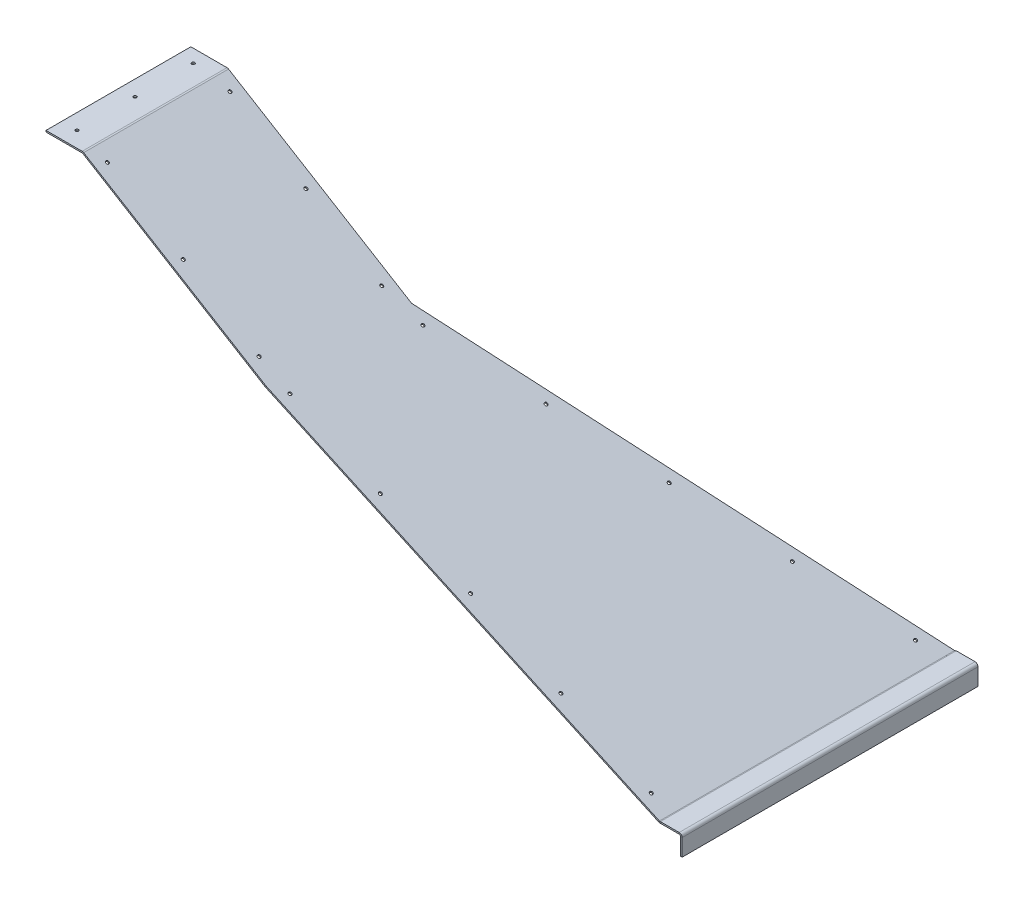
ISO-10303-21;
HEADER;
FILE_DESCRIPTION(('STEP AP214'),'2;1');
FILE_NAME('part.step','',(''),(''),'','','');
FILE_SCHEMA(('AUTOMOTIVE_DESIGN { 1 0 10303 214 1 1 1 1 }'));
ENDSEC;
DATA;
#1=APPLICATION_CONTEXT('core data for automotive mechanical design processes');
#2=APPLICATION_PROTOCOL_DEFINITION('international standard','automotive_design',2000,#1);
#3=PRODUCT_CONTEXT('',#1,'mechanical');
#4=PRODUCT('Part','Part','',(#3));
#5=PRODUCT_RELATED_PRODUCT_CATEGORY('part','',(#4));
#6=PRODUCT_DEFINITION_FORMATION('','',#4);
#7=PRODUCT_DEFINITION_CONTEXT('part definition',#1,'design');
#8=PRODUCT_DEFINITION('design','',#6,#7);
#9=PRODUCT_DEFINITION_SHAPE('','',#8);
#10=(LENGTH_UNIT() NAMED_UNIT(*) SI_UNIT(.MILLI.,.METRE.));
#11=(NAMED_UNIT(*) PLANE_ANGLE_UNIT() SI_UNIT($,.RADIAN.));
#12=(NAMED_UNIT(*) SI_UNIT($,.STERADIAN.) SOLID_ANGLE_UNIT());
#13=UNCERTAINTY_MEASURE_WITH_UNIT(LENGTH_MEASURE(1.E-05),#10,'distance_accuracy_value','');
#14=(GEOMETRIC_REPRESENTATION_CONTEXT(3) GLOBAL_UNCERTAINTY_ASSIGNED_CONTEXT((#13)) GLOBAL_UNIT_ASSIGNED_CONTEXT((#10,
#11,#12)) REPRESENTATION_CONTEXT('',''));
#15=CARTESIAN_POINT('',(0.,0.,0.));
#16=DIRECTION('',(0.,0.,1.));
#17=DIRECTION('',(1.,0.,0.));
#18=AXIS2_PLACEMENT_3D('',#15,#16,#17);
#19=CARTESIAN_POINT('',(-30.,-2.,200.));
#20=DIRECTION('',(0.,1.,0.));
#21=DIRECTION('',(0.,0.,1.));
#22=AXIS2_PLACEMENT_3D('',#19,#20,#21);
#23=PLANE('',#22);
#24=DIRECTION('',(0.,0.,1.));
#25=VECTOR('',#24,1.);
#26=CARTESIAN_POINT('',(-3.99999999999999,-2.,200.));
#27=LINE('',#26,#25);
#28=CARTESIAN_POINT('',(-3.99999999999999,-2.,200.));
#29=VERTEX_POINT('',#28);
#30=CARTESIAN_POINT('',(-3.99999999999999,-2.,-200.));
#31=VERTEX_POINT('',#30);
#32=EDGE_CURVE('E240',#29,#31,#27,.F.);
#33=ORIENTED_EDGE('',*,*,#32,.F.);
#34=DIRECTION('',(1.,0.,0.));
#35=VECTOR('',#34,1.);
#36=CARTESIAN_POINT('',(-30.,-2.,200.));
#37=LINE('',#36,#35);
#38=CARTESIAN_POINT('',(-28.6793571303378,-2.,200.));
#39=VERTEX_POINT('',#38);
#40=EDGE_CURVE('E318',#29,#39,#37,.F.);
#41=ORIENTED_EDGE('',*,*,#40,.T.);
#42=DIRECTION('',(-0.994705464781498,0.,0.1027669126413));
#43=VECTOR('',#42,1.);
#44=CARTESIAN_POINT('',(-28.6793571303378,-2.,200.));
#45=LINE('',#44,#43);
#46=CARTESIAN_POINT('',(-29.4395430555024,-2.,200.078537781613));
#47=VERTEX_POINT('',#46);
#48=EDGE_CURVE('E315',#39,#47,#45,.T.);
#49=ORIENTED_EDGE('',*,*,#48,.T.);
#50=DIRECTION('',(0.,0.,-1.));
#51=VECTOR('',#50,1.);
#52=CARTESIAN_POINT('',(-29.4395430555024,-2.,200.));
#53=LINE('',#52,#51);
#54=CARTESIAN_POINT('',(-29.4395430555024,-2.,-200.));
#55=VERTEX_POINT('',#54);
#56=EDGE_CURVE('E352',#47,#55,#53,.T.);
#57=ORIENTED_EDGE('',*,*,#56,.T.);
#58=DIRECTION('',(1.,0.,0.));
#59=VECTOR('',#58,1.);
#60=CARTESIAN_POINT('',(-30.,-2.,-200.));
#61=LINE('',#60,#59);
#62=EDGE_CURVE('E346',#55,#31,#61,.T.);
#63=ORIENTED_EDGE('',*,*,#62,.T.);
#64=EDGE_LOOP('',(#33,#41,#49,#57,#63));
#65=FACE_BOUND('',#64,.T.);
#66=ADVANCED_FACE('F60',(#65),#23,.F.);
#67=CARTESIAN_POINT('',(-30.,0.,200.));
#68=DIRECTION('',(0.,1.,0.));
#69=DIRECTION('',(0.,0.,1.));
#70=AXIS2_PLACEMENT_3D('',#67,#68,#69);
#71=PLANE('',#70);
#72=DIRECTION('',(-1.,0.,0.));
#73=VECTOR('',#72,1.);
#74=CARTESIAN_POINT('',(-28.6793571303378,0.,200.));
#75=LINE('',#74,#73);
#76=CARTESIAN_POINT('',(-3.99999999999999,0.,200.));
#77=VERTEX_POINT('',#76);
#78=CARTESIAN_POINT('',(-28.6793571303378,0.,200.));
#79=VERTEX_POINT('',#78);
#80=EDGE_CURVE('E313',#77,#79,#75,.T.);
#81=ORIENTED_EDGE('',*,*,#80,.F.);
#82=DIRECTION('',(0.,0.,1.));
#83=VECTOR('',#82,1.);
#84=CARTESIAN_POINT('',(-3.99999999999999,0.,200.));
#85=LINE('',#84,#83);
#86=CARTESIAN_POINT('',(-3.99999999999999,0.,-200.));
#87=VERTEX_POINT('',#86);
#88=EDGE_CURVE('E245',#77,#87,#85,.F.);
#89=ORIENTED_EDGE('',*,*,#88,.T.);
#90=DIRECTION('',(1.,0.,0.));
#91=VECTOR('',#90,1.);
#92=CARTESIAN_POINT('',(-30.,0.,-200.));
#93=LINE('',#92,#91);
#94=CARTESIAN_POINT('',(-29.4395430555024,0.,-200.));
#95=VERTEX_POINT('',#94);
#96=EDGE_CURVE('E349',#95,#87,#93,.T.);
#97=ORIENTED_EDGE('',*,*,#96,.F.);
#98=DIRECTION('',(0.,0.,-1.));
#99=VECTOR('',#98,1.);
#100=CARTESIAN_POINT('',(-29.4395430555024,0.,200.));
#101=LINE('',#100,#99);
#102=CARTESIAN_POINT('',(-29.4395430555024,0.,200.078537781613));
#103=VERTEX_POINT('',#102);
#104=EDGE_CURVE('E379',#103,#95,#101,.T.);
#105=ORIENTED_EDGE('',*,*,#104,.F.);
#106=DIRECTION('',(-0.994705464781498,0.,0.1027669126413));
#107=VECTOR('',#106,1.);
#108=CARTESIAN_POINT('',(-28.6793571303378,0.,200.));
#109=LINE('',#108,#107);
#110=EDGE_CURVE('E309',#79,#103,#109,.T.);
#111=ORIENTED_EDGE('',*,*,#110,.F.);
#112=EDGE_LOOP('',(#81,#89,#97,#105,#111));
#113=FACE_BOUND('',#112,.T.);
#114=ADVANCED_FACE('F421',(#113),#71,.T.);
#115=CARTESIAN_POINT('',(-28.6793571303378,0.,200.));
#116=DIRECTION('',(0.,0.,-1.));
#117=DIRECTION('',(-1.,0.,0.));
#118=AXIS2_PLACEMENT_3D('',#115,#116,#117);
#119=PLANE('',#118);
#120=ORIENTED_EDGE('',*,*,#40,.F.);
#121=DIRECTION('',(0.,1.,0.));
#122=VECTOR('',#121,1.);
#123=CARTESIAN_POINT('',(-3.99999999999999,-2.,200.));
#124=LINE('',#123,#122);
#125=EDGE_CURVE('E251',#29,#77,#124,.T.);
#126=ORIENTED_EDGE('',*,*,#125,.T.);
#127=ORIENTED_EDGE('',*,*,#80,.T.);
#128=DIRECTION('',(0.,1.,0.));
#129=VECTOR('',#128,1.);
#130=CARTESIAN_POINT('',(-28.6793571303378,0.,200.));
#131=LINE('',#130,#129);
#132=EDGE_CURVE('E321',#79,#39,#131,.F.);
#133=ORIENTED_EDGE('',*,*,#132,.T.);
#134=EDGE_LOOP('',(#120,#126,#127,#133));
#135=FACE_BOUND('',#134,.T.);
#136=ADVANCED_FACE('F414',(#135),#119,.F.);
#137=CARTESIAN_POINT('',(-29.4395430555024,2.00000000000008,200.));
#138=DIRECTION('',(0.,0.,-1.));
#139=DIRECTION('',(-1.,0.,0.));
#140=AXIS2_PLACEMENT_3D('',#137,#138,#139);
#141=CYLINDRICAL_SURFACE('',#140,2.);
#142=ORIENTED_EDGE('',*,*,#104,.T.);
#143=CARTESIAN_POINT('',(-29.4395430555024,2.00000000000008,-200.));
#144=DIRECTION('',(0.724841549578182,0.,0.688915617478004));
#145=DIRECTION('',(0.688915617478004,0.,-0.724841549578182));
#146=AXIS2_PLACEMENT_3D('',#143,#144,#145);
#147=ELLIPSE('',#146,2.90311316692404,2.);
#148=CARTESIAN_POINT('',(-30.4788428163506,0.291241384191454,-198.906502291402));
#149=VERTEX_POINT('',#148);
#150=EDGE_CURVE('E83',#95,#149,#147,.F.);
#151=ORIENTED_EDGE('',*,*,#150,.T.);
#152=DIRECTION('',(0.,0.,-1.));
#153=VECTOR('',#152,1.);
#154=CARTESIAN_POINT('',(-30.4788428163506,0.291241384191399,200.));
#155=LINE('',#154,#153);
#156=CARTESIAN_POINT('',(-30.4788428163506,0.291241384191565,200.185911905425));
#157=VERTEX_POINT('',#156);
#158=EDGE_CURVE('E376',#157,#149,#155,.T.);
#159=ORIENTED_EDGE('',*,*,#158,.F.);
#160=CARTESIAN_POINT('',(-29.4395430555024,2.00000000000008,200.078537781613));
#161=DIRECTION('',(0.1027669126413,0.,0.994705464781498));
#162=DIRECTION('',(0.994705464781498,0.,-0.1027669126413));
#163=AXIS2_PLACEMENT_3D('',#160,#161,#162);
#164=ELLIPSE('',#163,2.01064543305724,2.);
#165=EDGE_CURVE('E296',#103,#157,#164,.F.);
#166=ORIENTED_EDGE('',*,*,#165,.F.);
#167=EDGE_LOOP('',(#142,#151,#159,#166));
#168=FACE_BOUND('',#167,.T.);
#169=ADVANCED_FACE('F403',(#168),#141,.F.);
#170=CARTESIAN_POINT('',(-759.99999999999,444.,200.));
#171=DIRECTION('',(0.51964988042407,0.854379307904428,0.));
#172=DIRECTION('',(-0.854379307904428,0.51964988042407,0.));
#173=AXIS2_PLACEMENT_3D('',#170,#171,#172);
#174=PLANE('',#173);
#175=CARTESIAN_POINT('',(-54.3643661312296,14.8188747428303,-169.895438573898));
#176=DIRECTION('',(0.51964988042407,0.854379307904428,0.));
#177=DIRECTION('',(-0.854379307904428,0.51964988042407,0.));
#178=AXIS2_PLACEMENT_3D('',#175,#176,#177);
#179=CIRCLE('',#178,2.1);
#180=CARTESIAN_POINT('',(-56.1585626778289,15.9101394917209,-169.895438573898));
#181=VERTEX_POINT('',#180);
#182=EDGE_CURVE('E899',#181,#181,#179,.T.);
#183=ORIENTED_EDGE('',*,*,#182,.F.);
#184=EDGE_LOOP('',(#183));
#185=FACE_BOUND('',#184,.T.);
#186=CARTESIAN_POINT('',(-163.463878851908,81.1752906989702,-112.500992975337));
#187=DIRECTION('',(0.51964988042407,0.854379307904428,0.));
#188=DIRECTION('',(-0.854379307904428,0.51964988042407,0.));
#189=AXIS2_PLACEMENT_3D('',#186,#187,#188);
#190=CIRCLE('',#189,2.1);
#191=CARTESIAN_POINT('',(-165.258075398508,82.2665554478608,-112.500992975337));
#192=VERTEX_POINT('',#191);
#193=EDGE_CURVE('E903',#192,#192,#190,.T.);
#194=ORIENTED_EDGE('',*,*,#193,.F.);
#195=EDGE_LOOP('',(#194));
#196=FACE_BOUND('',#195,.T.);
#197=CARTESIAN_POINT('',(-272.563391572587,147.53170665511,-55.1065473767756));
#198=DIRECTION('',(0.51964988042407,0.854379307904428,0.));
#199=DIRECTION('',(-0.854379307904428,0.51964988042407,0.));
#200=AXIS2_PLACEMENT_3D('',#197,#198,#199);
#201=CIRCLE('',#200,2.1);
#202=CARTESIAN_POINT('',(-274.357588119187,148.622971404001,-55.1065473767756));
#203=VERTEX_POINT('',#202);
#204=EDGE_CURVE('E912',#203,#203,#201,.T.);
#205=ORIENTED_EDGE('',*,*,#204,.F.);
#206=EDGE_LOOP('',(#205));
#207=FACE_BOUND('',#206,.T.);
#208=CARTESIAN_POINT('',(-381.662904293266,213.88812261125,2.28789822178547));
#209=DIRECTION('',(0.51964988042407,0.854379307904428,0.));
#210=DIRECTION('',(-0.854379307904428,0.51964988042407,0.));
#211=AXIS2_PLACEMENT_3D('',#208,#209,#210);
#212=CIRCLE('',#211,2.1);
#213=CARTESIAN_POINT('',(-383.457100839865,214.97938736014,2.28789822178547));
#214=VERTEX_POINT('',#213);
#215=EDGE_CURVE('E918',#214,#214,#212,.T.);
#216=ORIENTED_EDGE('',*,*,#215,.F.);
#217=EDGE_LOOP('',(#216));
#218=FACE_BOUND('',#217,.T.);
#219=CARTESIAN_POINT('',(-490.762417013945,280.24453856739,59.6823438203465));
#220=DIRECTION('',(0.51964988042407,0.854379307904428,0.));
#221=DIRECTION('',(-0.854379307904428,0.51964988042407,0.));
#222=AXIS2_PLACEMENT_3D('',#219,#220,#221);
#223=CIRCLE('',#222,2.1);
#224=CARTESIAN_POINT('',(-492.556613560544,281.33580331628,59.6823438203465));
#225=VERTEX_POINT('',#224);
#226=EDGE_CURVE('E924',#225,#225,#223,.T.);
#227=ORIENTED_EDGE('',*,*,#226,.F.);
#228=EDGE_LOOP('',(#227));
#229=FACE_BOUND('',#228,.T.);
#230=CARTESIAN_POINT('',(-639.429211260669,370.666533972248,69.2));
#231=DIRECTION('',(0.51964988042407,0.854379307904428,0.));
#232=DIRECTION('',(-0.854379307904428,0.51964988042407,0.));
#233=AXIS2_PLACEMENT_3D('',#230,#231,#232);
#234=CIRCLE('',#233,2.09999999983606);
#235=CARTESIAN_POINT('',(-641.223407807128,371.757798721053,69.2));
#236=VERTEX_POINT('',#235);
#237=EDGE_CURVE('E930',#236,#236,#234,.T.);
#238=ORIENTED_EDGE('',*,*,#237,.F.);
#239=EDGE_LOOP('',(#238));
#240=FACE_BOUND('',#239,.T.);
#241=CARTESIAN_POINT('',(-741.9547282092,433.024519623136,69.2));
#242=DIRECTION('',(0.51964988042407,0.854379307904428,0.));
#243=DIRECTION('',(-0.854379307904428,0.51964988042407,0.));
#244=AXIS2_PLACEMENT_3D('',#241,#242,#243);
#245=CIRCLE('',#244,2.09999999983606);
#246=CARTESIAN_POINT('',(-743.74892475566,434.115784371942,69.2));
#247=VERTEX_POINT('',#246);
#248=EDGE_CURVE('E936',#247,#247,#245,.T.);
#249=ORIENTED_EDGE('',*,*,#248,.F.);
#250=EDGE_LOOP('',(#249));
#251=FACE_BOUND('',#250,.T.);
#252=CARTESIAN_POINT('',(-54.1902280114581,14.7129605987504,187.577305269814));
#253=DIRECTION('',(0.51964988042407,0.854379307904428,0.));
#254=DIRECTION('',(-0.854379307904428,0.51964988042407,0.));
#255=AXIS2_PLACEMENT_3D('',#252,#253,#254);
#256=CIRCLE('',#255,2.1);
#257=CARTESIAN_POINT('',(-55.9844245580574,15.804225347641,187.577305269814));
#258=VERTEX_POINT('',#257);
#259=EDGE_CURVE('E952',#258,#258,#256,.T.);
#260=ORIENTED_EDGE('',*,*,#259,.F.);
#261=EDGE_LOOP('',(#260));
#262=FACE_BOUND('',#261,.T.);
#263=CARTESIAN_POINT('',(-164.829353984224,82.0057988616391,199.007866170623));
#264=DIRECTION('',(0.51964988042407,0.854379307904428,0.));
#265=DIRECTION('',(-0.854379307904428,0.51964988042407,0.));
#266=AXIS2_PLACEMENT_3D('',#263,#264,#265);
#267=CIRCLE('',#266,2.1);
#268=CARTESIAN_POINT('',(-166.623550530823,83.0970636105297,199.007866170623));
#269=VERTEX_POINT('',#268);
#270=EDGE_CURVE('E960',#269,#269,#267,.T.);
#271=ORIENTED_EDGE('',*,*,#270,.F.);
#272=EDGE_LOOP('',(#271));
#273=FACE_BOUND('',#272,.T.);
#274=CARTESIAN_POINT('',(-275.46847995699,149.298637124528,210.438427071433));
#275=DIRECTION('',(0.51964988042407,0.854379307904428,0.));
#276=DIRECTION('',(-0.854379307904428,0.51964988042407,0.));
#277=AXIS2_PLACEMENT_3D('',#274,#275,#276);
#278=CIRCLE('',#277,2.1);
#279=CARTESIAN_POINT('',(-277.262676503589,150.389901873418,210.438427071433));
#280=VERTEX_POINT('',#279);
#281=EDGE_CURVE('E966',#280,#280,#278,.T.);
#282=ORIENTED_EDGE('',*,*,#281,.F.);
#283=EDGE_LOOP('',(#282));
#284=FACE_BOUND('',#283,.T.);
#285=CARTESIAN_POINT('',(-386.107605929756,216.591475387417,221.868987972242));
#286=DIRECTION('',(0.51964988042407,0.854379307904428,0.));
#287=DIRECTION('',(-0.854379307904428,0.51964988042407,0.));
#288=AXIS2_PLACEMENT_3D('',#285,#286,#287);
#289=CIRCLE('',#288,2.1);
#290=CARTESIAN_POINT('',(-387.901802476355,217.682740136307,221.868987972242));
#291=VERTEX_POINT('',#290);
#292=EDGE_CURVE('E972',#291,#291,#289,.T.);
#293=ORIENTED_EDGE('',*,*,#292,.F.);
#294=EDGE_LOOP('',(#293));
#295=FACE_BOUND('',#294,.T.);
#296=CARTESIAN_POINT('',(-496.746731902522,283.884313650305,233.299548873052));
#297=DIRECTION('',(0.51964988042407,0.854379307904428,0.));
#298=DIRECTION('',(-0.854379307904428,0.51964988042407,0.));
#299=AXIS2_PLACEMENT_3D('',#296,#297,#298);
#300=CIRCLE('',#299,2.1);
#301=CARTESIAN_POINT('',(-498.540928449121,284.975578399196,233.299548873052));
#302=VERTEX_POINT('',#301);
#303=EDGE_CURVE('E978',#302,#302,#300,.T.);
#304=ORIENTED_EDGE('',*,*,#303,.F.);
#305=EDGE_LOOP('',(#304));
#306=FACE_BOUND('',#305,.T.);
#307=CARTESIAN_POINT('',(-639.429211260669,370.666533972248,235.));
#308=DIRECTION('',(0.51964988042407,0.854379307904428,0.));
#309=DIRECTION('',(-0.854379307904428,0.51964988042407,0.));
#310=AXIS2_PLACEMENT_3D('',#307,#308,#309);
#311=CIRCLE('',#310,2.10000000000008);
#312=CARTESIAN_POINT('',(-641.223407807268,371.757798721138,235.));
#313=VERTEX_POINT('',#312);
#314=EDGE_CURVE('E984',#313,#313,#311,.T.);
#315=ORIENTED_EDGE('',*,*,#314,.F.);
#316=EDGE_LOOP('',(#315));
#317=FACE_BOUND('',#316,.T.);
#318=CARTESIAN_POINT('',(-741.9547282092,433.024519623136,235.));
#319=DIRECTION('',(0.51964988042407,0.854379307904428,0.));
#320=DIRECTION('',(-0.854379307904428,0.51964988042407,0.));
#321=AXIS2_PLACEMENT_3D('',#318,#319,#320);
#322=CIRCLE('',#321,2.10000000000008);
#323=CARTESIAN_POINT('',(-743.7489247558,434.115784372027,235.));
#324=VERTEX_POINT('',#323);
#325=EDGE_CURVE('E990',#324,#324,#322,.T.);
#326=ORIENTED_EDGE('',*,*,#325,.F.);
#327=EDGE_LOOP('',(#326));
#328=FACE_BOUND('',#327,.T.);
#329=DIRECTION('',(-0.779282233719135,0.473974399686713,0.409960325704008));
#330=VECTOR('',#329,1.);
#331=CARTESIAN_POINT('',(-403.301323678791,227.049024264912,-2.77419095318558));
#332=LINE('',#331,#330);
#333=CARTESIAN_POINT('',(-511.601985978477,292.919564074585,54.2));
#334=VERTEX_POINT('',#333);
#335=EDGE_CURVE('E280',#149,#334,#332,.T.);
#336=ORIENTED_EDGE('',*,*,#335,.T.);
#337=DIRECTION('',(-0.854379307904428,0.51964988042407,0.));
#338=VECTOR('',#337,1.);
#339=CARTESIAN_POINT('',(-598.483521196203,345.76258001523,54.2));
#340=LINE('',#339,#338);
#341=CARTESIAN_POINT('',(-759.042314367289,443.417517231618,54.2));
#342=VERTEX_POINT('',#341);
#343=EDGE_CURVE('E288',#334,#342,#340,.T.);
#344=ORIENTED_EDGE('',*,*,#343,.T.);
#345=DIRECTION('',(0.,0.,-1.));
#346=VECTOR('',#345,1.);
#347=CARTESIAN_POINT('',(-759.042314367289,443.417517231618,200.));
#348=LINE('',#347,#346);
#349=CARTESIAN_POINT('',(-759.042314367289,443.417517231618,250.));
#350=VERTEX_POINT('',#349);
#351=EDGE_CURVE('E373',#350,#342,#348,.T.);
#352=ORIENTED_EDGE('',*,*,#351,.F.);
#353=DIRECTION('',(-0.854379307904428,0.51964988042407,0.));
#354=VECTOR('',#353,1.);
#355=CARTESIAN_POINT('',(-759.042314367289,443.417517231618,250.));
#356=LINE('',#355,#354);
#357=CARTESIAN_POINT('',(-512.641285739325,293.551686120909,250.));
#358=VERTEX_POINT('',#357);
#359=EDGE_CURVE('E324',#358,#350,#356,.T.);
#360=ORIENTED_EDGE('',*,*,#359,.F.);
#361=DIRECTION('',(-0.851070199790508,0.517637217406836,0.0879273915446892));
#362=VECTOR('',#361,1.);
#363=CARTESIAN_POINT('',(-224.635912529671,118.381294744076,220.245038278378));
#364=LINE('',#363,#362);
#365=EDGE_CURVE('E75',#157,#358,#364,.T.);
#366=ORIENTED_EDGE('',*,*,#365,.F.);
#367=ORIENTED_EDGE('',*,*,#158,.T.);
#368=EDGE_LOOP('',(#336,#344,#352,#360,#366,#367));
#369=FACE_BOUND('',#368,.T.);
#370=CARTESIAN_POINT('',(-536.903694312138,308.308548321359,235.));
#371=DIRECTION('',(0.51964988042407,0.854379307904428,0.));
#372=DIRECTION('',(-0.854379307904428,0.51964988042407,0.));
#373=AXIS2_PLACEMENT_3D('',#370,#371,#372);
#374=CIRCLE('',#373,2.10000000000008);
#375=CARTESIAN_POINT('',(-538.697890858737,309.39981307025,235.));
#376=VERTEX_POINT('',#375);
#377=EDGE_CURVE('E384',#376,#376,#374,.T.);
#378=ORIENTED_EDGE('',*,*,#377,.F.);
#379=EDGE_LOOP('',(#378));
#380=FACE_BOUND('',#379,.T.);
#381=CARTESIAN_POINT('',(-536.903694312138,308.308548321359,69.2));
#382=DIRECTION('',(0.51964988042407,0.854379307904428,0.));
#383=DIRECTION('',(-0.854379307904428,0.51964988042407,0.));
#384=AXIS2_PLACEMENT_3D('',#381,#382,#383);
#385=CIRCLE('',#384,2.09999999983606);
#386=CARTESIAN_POINT('',(-538.697890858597,309.399813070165,69.2));
#387=VERTEX_POINT('',#386);
#388=EDGE_CURVE('E68',#387,#387,#385,.T.);
#389=ORIENTED_EDGE('',*,*,#388,.F.);
#390=EDGE_LOOP('',(#389));
#391=FACE_BOUND('',#390,.T.);
#392=ADVANCED_FACE('F400',(#185,#196,#207,#218,#229,#240,#251,#262,#273,#284,#295,#306,#317,
#328,#369,#380,#391),#174,.T.);
#393=CARTESIAN_POINT('',(-761.039299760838,442.291241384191,200.));
#394=DIRECTION('',(0.51964988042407,0.854379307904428,0.));
#395=DIRECTION('',(-0.854379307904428,0.51964988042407,0.));
#396=AXIS2_PLACEMENT_3D('',#393,#394,#395);
#397=PLANE('',#396);
#398=CARTESIAN_POINT('',(-55.4036658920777,13.1101161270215,-169.895438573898));
#399=DIRECTION('',(0.51964988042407,0.854379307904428,0.));
#400=DIRECTION('',(-0.854379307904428,0.51964988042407,0.));
#401=AXIS2_PLACEMENT_3D('',#398,#399,#400);
#402=CIRCLE('',#401,2.1);
#403=CARTESIAN_POINT('',(-57.197862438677,14.201380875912,-169.895438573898));
#404=VERTEX_POINT('',#403);
#405=EDGE_CURVE('E902',#404,#404,#402,.F.);
#406=ORIENTED_EDGE('',*,*,#405,.F.);
#407=EDGE_LOOP('',(#406));
#408=FACE_BOUND('',#407,.T.);
#409=CARTESIAN_POINT('',(-164.503178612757,79.4665320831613,-112.500992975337));
#410=DIRECTION('',(0.51964988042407,0.854379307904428,0.));
#411=DIRECTION('',(-0.854379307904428,0.51964988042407,0.));
#412=AXIS2_PLACEMENT_3D('',#409,#410,#411);
#413=CIRCLE('',#412,2.1);
#414=CARTESIAN_POINT('',(-166.297375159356,80.5577968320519,-112.500992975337));
#415=VERTEX_POINT('',#414);
#416=EDGE_CURVE('E906',#415,#415,#413,.F.);
#417=ORIENTED_EDGE('',*,*,#416,.F.);
#418=EDGE_LOOP('',(#417));
#419=FACE_BOUND('',#418,.T.);
#420=CARTESIAN_POINT('',(-273.602691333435,145.822948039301,-55.1065473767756));
#421=DIRECTION('',(0.51964988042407,0.854379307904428,0.));
#422=DIRECTION('',(-0.854379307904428,0.51964988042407,0.));
#423=AXIS2_PLACEMENT_3D('',#420,#421,#422);
#424=CIRCLE('',#423,2.1);
#425=CARTESIAN_POINT('',(-275.396887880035,146.914212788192,-55.1065473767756));
#426=VERTEX_POINT('',#425);
#427=EDGE_CURVE('E915',#426,#426,#424,.F.);
#428=ORIENTED_EDGE('',*,*,#427,.F.);
#429=EDGE_LOOP('',(#428));
#430=FACE_BOUND('',#429,.T.);
#431=CARTESIAN_POINT('',(-382.702204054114,212.179363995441,2.28789822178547));
#432=DIRECTION('',(0.51964988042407,0.854379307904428,0.));
#433=DIRECTION('',(-0.854379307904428,0.51964988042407,0.));
#434=AXIS2_PLACEMENT_3D('',#431,#432,#433);
#435=CIRCLE('',#434,2.1);
#436=CARTESIAN_POINT('',(-384.496400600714,213.270628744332,2.28789822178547));
#437=VERTEX_POINT('',#436);
#438=EDGE_CURVE('E921',#437,#437,#435,.F.);
#439=ORIENTED_EDGE('',*,*,#438,.F.);
#440=EDGE_LOOP('',(#439));
#441=FACE_BOUND('',#440,.T.);
#442=CARTESIAN_POINT('',(-491.801716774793,278.535779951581,59.6823438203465));
#443=DIRECTION('',(0.51964988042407,0.854379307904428,0.));
#444=DIRECTION('',(-0.854379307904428,0.51964988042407,0.));
#445=AXIS2_PLACEMENT_3D('',#442,#443,#444);
#446=CIRCLE('',#445,2.1);
#447=CARTESIAN_POINT('',(-493.595913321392,279.627044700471,59.6823438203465));
#448=VERTEX_POINT('',#447);
#449=EDGE_CURVE('E927',#448,#448,#446,.F.);
#450=ORIENTED_EDGE('',*,*,#449,.F.);
#451=EDGE_LOOP('',(#450));
#452=FACE_BOUND('',#451,.T.);
#453=CARTESIAN_POINT('',(-640.468511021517,368.957775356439,69.2));
#454=DIRECTION('',(0.51964988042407,0.854379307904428,0.));
#455=DIRECTION('',(-0.854379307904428,0.51964988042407,0.));
#456=AXIS2_PLACEMENT_3D('',#453,#454,#455);
#457=CIRCLE('',#456,2.09999999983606);
#458=CARTESIAN_POINT('',(-642.262707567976,370.049040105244,69.2));
#459=VERTEX_POINT('',#458);
#460=EDGE_CURVE('E933',#459,#459,#457,.F.);
#461=ORIENTED_EDGE('',*,*,#460,.F.);
#462=EDGE_LOOP('',(#461));
#463=FACE_BOUND('',#462,.T.);
#464=CARTESIAN_POINT('',(-742.994027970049,431.315761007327,69.2));
#465=DIRECTION('',(0.51964988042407,0.854379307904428,0.));
#466=DIRECTION('',(-0.854379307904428,0.51964988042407,0.));
#467=AXIS2_PLACEMENT_3D('',#464,#465,#466);
#468=CIRCLE('',#467,2.09999999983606);
#469=CARTESIAN_POINT('',(-744.788224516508,432.407025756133,69.2));
#470=VERTEX_POINT('',#469);
#471=EDGE_CURVE('E939',#470,#470,#468,.F.);
#472=ORIENTED_EDGE('',*,*,#471,.F.);
#473=EDGE_LOOP('',(#472));
#474=FACE_BOUND('',#473,.T.);
#475=CARTESIAN_POINT('',(-55.2295277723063,13.0042019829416,187.577305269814));
#476=DIRECTION('',(0.51964988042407,0.854379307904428,0.));
#477=DIRECTION('',(-0.854379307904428,0.51964988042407,0.));
#478=AXIS2_PLACEMENT_3D('',#475,#476,#477);
#479=CIRCLE('',#478,2.1);
#480=CARTESIAN_POINT('',(-57.0237243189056,14.0954667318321,187.577305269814));
#481=VERTEX_POINT('',#480);
#482=EDGE_CURVE('E957',#481,#481,#479,.F.);
#483=ORIENTED_EDGE('',*,*,#482,.F.);
#484=EDGE_LOOP('',(#483));
#485=FACE_BOUND('',#484,.T.);
#486=CARTESIAN_POINT('',(-165.868653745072,80.2970402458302,199.007866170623));
#487=DIRECTION('',(0.51964988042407,0.854379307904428,0.));
#488=DIRECTION('',(-0.854379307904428,0.51964988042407,0.));
#489=AXIS2_PLACEMENT_3D('',#486,#487,#488);
#490=CIRCLE('',#489,2.1);
#491=CARTESIAN_POINT('',(-167.662850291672,81.3883049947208,199.007866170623));
#492=VERTEX_POINT('',#491);
#493=EDGE_CURVE('E963',#492,#492,#490,.F.);
#494=ORIENTED_EDGE('',*,*,#493,.F.);
#495=EDGE_LOOP('',(#494));
#496=FACE_BOUND('',#495,.T.);
#497=CARTESIAN_POINT('',(-276.507779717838,147.589878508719,210.438427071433));
#498=DIRECTION('',(0.51964988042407,0.854379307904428,0.));
#499=DIRECTION('',(-0.854379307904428,0.51964988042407,0.));
#500=AXIS2_PLACEMENT_3D('',#497,#498,#499);
#501=CIRCLE('',#500,2.1);
#502=CARTESIAN_POINT('',(-278.301976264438,148.68114325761,210.438427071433));
#503=VERTEX_POINT('',#502);
#504=EDGE_CURVE('E969',#503,#503,#501,.F.);
#505=ORIENTED_EDGE('',*,*,#504,.F.);
#506=EDGE_LOOP('',(#505));
#507=FACE_BOUND('',#506,.T.);
#508=CARTESIAN_POINT('',(-387.146905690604,214.882716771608,221.868987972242));
#509=DIRECTION('',(0.51964988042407,0.854379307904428,0.));
#510=DIRECTION('',(-0.854379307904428,0.51964988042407,0.));
#511=AXIS2_PLACEMENT_3D('',#508,#509,#510);
#512=CIRCLE('',#511,2.1);
#513=CARTESIAN_POINT('',(-388.941102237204,215.973981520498,221.868987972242));
#514=VERTEX_POINT('',#513);
#515=EDGE_CURVE('E975',#514,#514,#512,.F.);
#516=ORIENTED_EDGE('',*,*,#515,.F.);
#517=EDGE_LOOP('',(#516));
#518=FACE_BOUND('',#517,.T.);
#519=CARTESIAN_POINT('',(-497.78603166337,282.175555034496,233.299548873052));
#520=DIRECTION('',(0.51964988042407,0.854379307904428,0.));
#521=DIRECTION('',(-0.854379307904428,0.51964988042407,0.));
#522=AXIS2_PLACEMENT_3D('',#519,#520,#521);
#523=CIRCLE('',#522,2.1);
#524=CARTESIAN_POINT('',(-499.58022820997,283.266819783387,233.299548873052));
#525=VERTEX_POINT('',#524);
#526=EDGE_CURVE('E981',#525,#525,#523,.F.);
#527=ORIENTED_EDGE('',*,*,#526,.F.);
#528=EDGE_LOOP('',(#527));
#529=FACE_BOUND('',#528,.T.);
#530=CARTESIAN_POINT('',(-640.468511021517,368.957775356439,235.));
#531=DIRECTION('',(0.51964988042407,0.854379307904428,0.));
#532=DIRECTION('',(-0.854379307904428,0.51964988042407,0.));
#533=AXIS2_PLACEMENT_3D('',#530,#531,#532);
#534=CIRCLE('',#533,2.10000000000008);
#535=CARTESIAN_POINT('',(-642.262707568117,370.04904010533,235.));
#536=VERTEX_POINT('',#535);
#537=EDGE_CURVE('E987',#536,#536,#534,.F.);
#538=ORIENTED_EDGE('',*,*,#537,.F.);
#539=EDGE_LOOP('',(#538));
#540=FACE_BOUND('',#539,.T.);
#541=CARTESIAN_POINT('',(-742.994027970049,431.315761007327,235.));
#542=DIRECTION('',(0.51964988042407,0.854379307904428,0.));
#543=DIRECTION('',(-0.854379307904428,0.51964988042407,0.));
#544=AXIS2_PLACEMENT_3D('',#541,#542,#543);
#545=CIRCLE('',#544,2.10000000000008);
#546=CARTESIAN_POINT('',(-744.788224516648,432.407025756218,235.));
#547=VERTEX_POINT('',#546);
#548=EDGE_CURVE('E235',#547,#547,#545,.F.);
#549=ORIENTED_EDGE('',*,*,#548,.F.);
#550=EDGE_LOOP('',(#549));
#551=FACE_BOUND('',#550,.T.);
#552=DIRECTION('',(-0.854379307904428,0.51964988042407,0.));
#553=VECTOR('',#552,1.);
#554=CARTESIAN_POINT('',(-761.039299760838,442.291241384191,54.1999999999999));
#555=LINE('',#554,#553);
#556=CARTESIAN_POINT('',(-512.641285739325,291.210805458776,54.1999999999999));
#557=VERTEX_POINT('',#556);
#558=CARTESIAN_POINT('',(-760.081614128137,441.708758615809,54.2));
#559=VERTEX_POINT('',#558);
#560=EDGE_CURVE('E291',#557,#559,#555,.T.);
#561=ORIENTED_EDGE('',*,*,#560,.F.);
#562=DIRECTION('',(-0.779282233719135,0.473974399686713,0.409960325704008));
#563=VECTOR('',#562,1.);
#564=CARTESIAN_POINT('',(-404.340623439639,225.340265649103,-2.77419095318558));
#565=LINE('',#564,#563);
#566=CARTESIAN_POINT('',(-31.5181425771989,-1.41751723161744,-198.906502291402));
#567=VERTEX_POINT('',#566);
#568=EDGE_CURVE('E276',#567,#557,#565,.T.);
#569=ORIENTED_EDGE('',*,*,#568,.F.);
#570=DIRECTION('',(0.,0.,-1.));
#571=VECTOR('',#570,1.);
#572=CARTESIAN_POINT('',(-31.5181425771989,-1.41751723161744,200.));
#573=LINE('',#572,#571);
#574=CARTESIAN_POINT('',(-31.5181425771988,-1.41751723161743,200.185911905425));
#575=VERTEX_POINT('',#574);
#576=EDGE_CURVE('E355',#575,#567,#573,.T.);
#577=ORIENTED_EDGE('',*,*,#576,.F.);
#578=DIRECTION('',(-0.851070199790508,0.517637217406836,0.0879273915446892));
#579=VECTOR('',#578,1.);
#580=CARTESIAN_POINT('',(-225.67521229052,116.672536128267,220.245038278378));
#581=LINE('',#580,#579);
#582=CARTESIAN_POINT('',(-513.680585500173,291.8429275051,250.));
#583=VERTEX_POINT('',#582);
#584=EDGE_CURVE('E302',#575,#583,#581,.T.);
#585=ORIENTED_EDGE('',*,*,#584,.T.);
#586=DIRECTION('',(0.854379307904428,-0.51964988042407,0.));
#587=VECTOR('',#586,1.);
#588=CARTESIAN_POINT('',(-760.081614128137,441.708758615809,250.));
#589=LINE('',#588,#587);
#590=CARTESIAN_POINT('',(-760.081614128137,441.708758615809,250.));
#591=VERTEX_POINT('',#590);
#592=EDGE_CURVE('E343',#591,#583,#589,.T.);
#593=ORIENTED_EDGE('',*,*,#592,.F.);
#594=DIRECTION('',(0.,0.,-1.));
#595=VECTOR('',#594,1.);
#596=CARTESIAN_POINT('',(-760.081614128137,441.708758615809,200.));
#597=LINE('',#596,#595);
#598=EDGE_CURVE('E358',#591,#559,#597,.T.);
#599=ORIENTED_EDGE('',*,*,#598,.T.);
#600=EDGE_LOOP('',(#561,#569,#577,#585,#593,#599));
#601=FACE_BOUND('',#600,.T.);
#602=CARTESIAN_POINT('',(-537.942994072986,306.59978970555,235.));
#603=DIRECTION('',(0.51964988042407,0.854379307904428,0.));
#604=DIRECTION('',(-0.854379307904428,0.51964988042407,0.));
#605=AXIS2_PLACEMENT_3D('',#602,#603,#604);
#606=CIRCLE('',#605,2.10000000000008);
#607=CARTESIAN_POINT('',(-539.737190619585,307.691054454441,235.));
#608=VERTEX_POINT('',#607);
#609=EDGE_CURVE('E387',#608,#608,#606,.F.);
#610=ORIENTED_EDGE('',*,*,#609,.F.);
#611=EDGE_LOOP('',(#610));
#612=FACE_BOUND('',#611,.T.);
#613=CARTESIAN_POINT('',(-537.942994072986,306.599789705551,69.2));
#614=DIRECTION('',(0.51964988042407,0.854379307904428,0.));
#615=DIRECTION('',(-0.854379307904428,0.51964988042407,0.));
#616=AXIS2_PLACEMENT_3D('',#613,#614,#615);
#617=CIRCLE('',#616,2.09999999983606);
#618=CARTESIAN_POINT('',(-539.737190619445,307.691054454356,69.2));
#619=VERTEX_POINT('',#618);
#620=EDGE_CURVE('E13',#619,#619,#617,.F.);
#621=ORIENTED_EDGE('',*,*,#620,.F.);
#622=EDGE_LOOP('',(#621));
#623=FACE_BOUND('',#622,.T.);
#624=ADVANCED_FACE('F402',(#408,#419,#430,#441,#452,#463,#474,#485,#496,#507,#518,#529,#540,
#551,#601,#612,#623),#397,.F.);
#625=CARTESIAN_POINT('',(-29.4395430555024,2.00000000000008,200.));
#626=DIRECTION('',(0.,0.,-1.));
#627=DIRECTION('',(-1.,0.,0.));
#628=AXIS2_PLACEMENT_3D('',#625,#626,#627);
#629=CYLINDRICAL_SURFACE('',#628,4.);
#630=CARTESIAN_POINT('',(-29.4395430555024,2.00000000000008,-200.));
#631=DIRECTION('',(0.465579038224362,0.,0.885006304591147));
#632=DIRECTION('',(0.885006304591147,0.,-0.465579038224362));
#633=AXIS2_PLACEMENT_3D('',#630,#631,#632);
#634=ELLIPSE('',#633,4.51974181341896,4.);
#635=EDGE_CURVE('E257',#55,#567,#634,.F.);
#636=ORIENTED_EDGE('',*,*,#635,.F.);
#637=ORIENTED_EDGE('',*,*,#56,.F.);
#638=CARTESIAN_POINT('',(-29.4395430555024,2.00000000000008,200.078537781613));
#639=DIRECTION('',(0.0515881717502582,0.,0.998668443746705));
#640=DIRECTION('',(0.998668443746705,0.,-0.0515881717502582));
#641=AXIS2_PLACEMENT_3D('',#638,#639,#640);
#642=ELLIPSE('',#641,4.00533332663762,4.);
#643=EDGE_CURVE('E298',#47,#575,#642,.F.);
#644=ORIENTED_EDGE('',*,*,#643,.T.);
#645=ORIENTED_EDGE('',*,*,#576,.T.);
#646=EDGE_LOOP('',(#636,#637,#644,#645));
#647=FACE_BOUND('',#646,.T.);
#648=ADVANCED_FACE('F410',(#647),#629,.T.);
#649=CARTESIAN_POINT('',(-761.120913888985,440.,200.));
#650=DIRECTION('',(0.,0.,-1.));
#651=DIRECTION('',(-1.,0.,0.));
#652=AXIS2_PLACEMENT_3D('',#649,#650,#651);
#653=CYLINDRICAL_SURFACE('',#652,4.);
#654=ORIENTED_EDGE('',*,*,#351,.T.);
#655=CARTESIAN_POINT('',(-761.120913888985,440.,54.2));
#656=DIRECTION('',(0.,0.,1.));
#657=DIRECTION('',(1.,0.,0.));
#658=AXIS2_PLACEMENT_3D('',#655,#656,#657);
#659=CIRCLE('',#658,4.);
#660=CARTESIAN_POINT('',(-761.120913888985,444.,54.2));
#661=VERTEX_POINT('',#660);
#662=EDGE_CURVE('E262',#342,#661,#659,.T.);
#663=ORIENTED_EDGE('',*,*,#662,.T.);
#664=DIRECTION('',(0.,0.,-1.));
#665=VECTOR('',#664,1.);
#666=CARTESIAN_POINT('',(-761.120913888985,444.,200.));
#667=LINE('',#666,#665);
#668=CARTESIAN_POINT('',(-761.120913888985,444.,250.));
#669=VERTEX_POINT('',#668);
#670=EDGE_CURVE('E370',#669,#661,#667,.T.);
#671=ORIENTED_EDGE('',*,*,#670,.F.);
#672=CARTESIAN_POINT('',(-761.120913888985,440.,250.));
#673=DIRECTION('',(0.,0.,1.));
#674=DIRECTION('',(1.,0.,0.));
#675=AXIS2_PLACEMENT_3D('',#672,#673,#674);
#676=CIRCLE('',#675,4.00000000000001);
#677=EDGE_CURVE('E328',#350,#669,#676,.T.);
#678=ORIENTED_EDGE('',*,*,#677,.F.);
#679=EDGE_LOOP('',(#654,#663,#671,#678));
#680=FACE_BOUND('',#679,.T.);
#681=ADVANCED_FACE('F476',(#680),#653,.T.);
#682=CARTESIAN_POINT('',(-809.99999999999,444.,200.));
#683=DIRECTION('',(0.,1.,0.));
#684=DIRECTION('',(0.,0.,1.));
#685=AXIS2_PLACEMENT_3D('',#682,#683,#684);
#686=PLANE('',#685);
#687=CARTESIAN_POINT('',(-789.00000000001,444.,150.500000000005));
#688=DIRECTION('',(0.,1.,0.));
#689=DIRECTION('',(0.,0.,1.));
#690=AXIS2_PLACEMENT_3D('',#687,#688,#689);
#691=CIRCLE('',#690,2.10000000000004);
#692=CARTESIAN_POINT('',(-789.00000000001,444.,152.600000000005));
#693=VERTEX_POINT('',#692);
#694=EDGE_CURVE('E942',#693,#693,#691,.F.);
#695=ORIENTED_EDGE('',*,*,#694,.T.);
#696=EDGE_LOOP('',(#695));
#697=FACE_BOUND('',#696,.T.);
#698=CARTESIAN_POINT('',(-789.00000000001,444.,229.000000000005));
#699=DIRECTION('',(0.,1.,0.));
#700=DIRECTION('',(0.,0.,1.));
#701=AXIS2_PLACEMENT_3D('',#698,#699,#700);
#702=CIRCLE('',#701,2.10000000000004);
#703=CARTESIAN_POINT('',(-789.00000000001,444.,231.100000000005));
#704=VERTEX_POINT('',#703);
#705=EDGE_CURVE('E948',#704,#704,#702,.F.);
#706=ORIENTED_EDGE('',*,*,#705,.T.);
#707=EDGE_LOOP('',(#706));
#708=FACE_BOUND('',#707,.T.);
#709=ORIENTED_EDGE('',*,*,#670,.T.);
#710=DIRECTION('',(1.,0.,0.));
#711=VECTOR('',#710,1.);
#712=CARTESIAN_POINT('',(-809.99999999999,444.,54.2));
#713=LINE('',#712,#711);
#714=CARTESIAN_POINT('',(-809.99999999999,444.,54.2));
#715=VERTEX_POINT('',#714);
#716=EDGE_CURVE('E267',#715,#661,#713,.T.);
#717=ORIENTED_EDGE('',*,*,#716,.F.);
#718=DIRECTION('',(0.,0.,-1.));
#719=VECTOR('',#718,1.);
#720=CARTESIAN_POINT('',(-809.99999999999,444.,200.));
#721=LINE('',#720,#719);
#722=CARTESIAN_POINT('',(-809.99999999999,444.,250.));
#723=VERTEX_POINT('',#722);
#724=EDGE_CURVE('E367',#723,#715,#721,.T.);
#725=ORIENTED_EDGE('',*,*,#724,.F.);
#726=DIRECTION('',(-1.,0.,0.));
#727=VECTOR('',#726,1.);
#728=CARTESIAN_POINT('',(-809.99999999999,444.,250.));
#729=LINE('',#728,#727);
#730=EDGE_CURVE('E331',#669,#723,#729,.T.);
#731=ORIENTED_EDGE('',*,*,#730,.F.);
#732=EDGE_LOOP('',(#709,#717,#725,#731));
#733=FACE_BOUND('',#732,.T.);
#734=CARTESIAN_POINT('',(-789.00000000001,444.,72.0000000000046));
#735=DIRECTION('',(0.,1.,0.));
#736=DIRECTION('',(0.,0.,1.));
#737=AXIS2_PLACEMENT_3D('',#734,#735,#736);
#738=CIRCLE('',#737,2.10000000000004);
#739=CARTESIAN_POINT('',(-789.00000000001,444.,74.1000000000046));
#740=VERTEX_POINT('',#739);
#741=EDGE_CURVE('E390',#740,#740,#738,.F.);
#742=ORIENTED_EDGE('',*,*,#741,.T.);
#743=EDGE_LOOP('',(#742));
#744=FACE_BOUND('',#743,.T.);
#745=ADVANCED_FACE('F470',(#697,#708,#733,#744),#686,.T.);
#746=CARTESIAN_POINT('',(-809.99999999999,442.,200.));
#747=DIRECTION('',(-1.,0.,0.));
#748=DIRECTION('',(0.,0.,1.));
#749=AXIS2_PLACEMENT_3D('',#746,#747,#748);
#750=PLANE('',#749);
#751=ORIENTED_EDGE('',*,*,#724,.T.);
#752=DIRECTION('',(0.,1.,0.));
#753=VECTOR('',#752,1.);
#754=CARTESIAN_POINT('',(-809.99999999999,444.,54.2));
#755=LINE('',#754,#753);
#756=CARTESIAN_POINT('',(-809.99999999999,442.,54.2));
#757=VERTEX_POINT('',#756);
#758=EDGE_CURVE('E272',#715,#757,#755,.F.);
#759=ORIENTED_EDGE('',*,*,#758,.T.);
#760=DIRECTION('',(0.,0.,-1.));
#761=VECTOR('',#760,1.);
#762=CARTESIAN_POINT('',(-809.99999999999,442.,200.));
#763=LINE('',#762,#761);
#764=CARTESIAN_POINT('',(-809.99999999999,442.,250.));
#765=VERTEX_POINT('',#764);
#766=EDGE_CURVE('E364',#765,#757,#763,.T.);
#767=ORIENTED_EDGE('',*,*,#766,.F.);
#768=DIRECTION('',(0.,-1.,0.));
#769=VECTOR('',#768,1.);
#770=CARTESIAN_POINT('',(-809.99999999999,442.,250.));
#771=LINE('',#770,#769);
#772=EDGE_CURVE('E334',#723,#765,#771,.T.);
#773=ORIENTED_EDGE('',*,*,#772,.F.);
#774=EDGE_LOOP('',(#751,#759,#767,#773));
#775=FACE_BOUND('',#774,.T.);
#776=ADVANCED_FACE('F459',(#775),#750,.T.);
#777=CARTESIAN_POINT('',(-809.99999999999,442.,200.));
#778=DIRECTION('',(0.,1.,0.));
#779=DIRECTION('',(0.,0.,1.));
#780=AXIS2_PLACEMENT_3D('',#777,#778,#779);
#781=PLANE('',#780);
#782=CARTESIAN_POINT('',(-789.00000000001,442.,150.500000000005));
#783=DIRECTION('',(0.,-1.,0.));
#784=DIRECTION('',(0.,0.,-1.));
#785=AXIS2_PLACEMENT_3D('',#782,#783,#784);
#786=CIRCLE('',#785,2.10000000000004);
#787=CARTESIAN_POINT('',(-789.00000000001,442.,148.400000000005));
#788=VERTEX_POINT('',#787);
#789=EDGE_CURVE('E945',#788,#788,#786,.T.);
#790=ORIENTED_EDGE('',*,*,#789,.F.);
#791=EDGE_LOOP('',(#790));
#792=FACE_BOUND('',#791,.T.);
#793=CARTESIAN_POINT('',(-789.00000000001,442.,229.000000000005));
#794=DIRECTION('',(0.,-1.,0.));
#795=DIRECTION('',(0.,0.,-1.));
#796=AXIS2_PLACEMENT_3D('',#793,#794,#795);
#797=CIRCLE('',#796,2.10000000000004);
#798=CARTESIAN_POINT('',(-789.00000000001,442.,226.900000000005));
#799=VERTEX_POINT('',#798);
#800=EDGE_CURVE('E949',#799,#799,#797,.T.);
#801=ORIENTED_EDGE('',*,*,#800,.F.);
#802=EDGE_LOOP('',(#801));
#803=FACE_BOUND('',#802,.T.);
#804=DIRECTION('',(1.,0.,0.));
#805=VECTOR('',#804,1.);
#806=CARTESIAN_POINT('',(-809.99999999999,442.,54.2));
#807=LINE('',#806,#805);
#808=CARTESIAN_POINT('',(-761.120913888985,442.,54.2));
#809=VERTEX_POINT('',#808);
#810=EDGE_CURVE('E269',#757,#809,#807,.T.);
#811=ORIENTED_EDGE('',*,*,#810,.T.);
#812=DIRECTION('',(0.,0.,-1.));
#813=VECTOR('',#812,1.);
#814=CARTESIAN_POINT('',(-761.120913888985,442.,200.));
#815=LINE('',#814,#813);
#816=CARTESIAN_POINT('',(-761.120913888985,442.,250.));
#817=VERTEX_POINT('',#816);
#818=EDGE_CURVE('E361',#817,#809,#815,.T.);
#819=ORIENTED_EDGE('',*,*,#818,.F.);
#820=DIRECTION('',(1.,0.,0.));
#821=VECTOR('',#820,1.);
#822=CARTESIAN_POINT('',(-809.99999999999,442.,250.));
#823=LINE('',#822,#821);
#824=EDGE_CURVE('E337',#765,#817,#823,.T.);
#825=ORIENTED_EDGE('',*,*,#824,.F.);
#826=ORIENTED_EDGE('',*,*,#766,.T.);
#827=EDGE_LOOP('',(#811,#819,#825,#826));
#828=FACE_BOUND('',#827,.T.);
#829=CARTESIAN_POINT('',(-789.00000000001,442.,72.0000000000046));
#830=DIRECTION('',(0.,-1.,0.));
#831=DIRECTION('',(0.,0.,-1.));
#832=AXIS2_PLACEMENT_3D('',#829,#830,#831);
#833=CIRCLE('',#832,2.10000000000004);
#834=CARTESIAN_POINT('',(-789.00000000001,442.,69.9000000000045));
#835=VERTEX_POINT('',#834);
#836=EDGE_CURVE('E393',#835,#835,#833,.T.);
#837=ORIENTED_EDGE('',*,*,#836,.F.);
#838=EDGE_LOOP('',(#837));
#839=FACE_BOUND('',#838,.T.);
#840=ADVANCED_FACE('F456',(#792,#803,#828,#839),#781,.F.);
#841=CARTESIAN_POINT('',(-761.120913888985,440.,200.));
#842=DIRECTION('',(0.,0.,-1.));
#843=DIRECTION('',(-1.,0.,0.));
#844=AXIS2_PLACEMENT_3D('',#841,#842,#843);
#845=CYLINDRICAL_SURFACE('',#844,2.);
#846=CARTESIAN_POINT('',(-761.120913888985,440.,54.2));
#847=DIRECTION('',(0.,0.,-1.));
#848=DIRECTION('',(-1.,0.,0.));
#849=AXIS2_PLACEMENT_3D('',#846,#847,#848);
#850=CIRCLE('',#849,2.);
#851=EDGE_CURVE('E265',#559,#809,#850,.F.);
#852=ORIENTED_EDGE('',*,*,#851,.F.);
#853=ORIENTED_EDGE('',*,*,#598,.F.);
#854=CARTESIAN_POINT('',(-761.120913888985,440.,250.));
#855=DIRECTION('',(0.,0.,-1.));
#856=DIRECTION('',(1.,0.,0.));
#857=AXIS2_PLACEMENT_3D('',#854,#855,#856);
#858=CIRCLE('',#857,1.99999999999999);
#859=EDGE_CURVE('E340',#817,#591,#858,.T.);
#860=ORIENTED_EDGE('',*,*,#859,.F.);
#861=ORIENTED_EDGE('',*,*,#818,.T.);
#862=EDGE_LOOP('',(#852,#853,#860,#861));
#863=FACE_BOUND('',#862,.T.);
#864=ADVANCED_FACE('F458',(#863),#845,.F.);
#865=CARTESIAN_POINT('',(-29.4395430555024,2.00000000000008,250.));
#866=DIRECTION('',(0.,0.,1.));
#867=DIRECTION('',(1.,0.,0.));
#868=AXIS2_PLACEMENT_3D('',#865,#866,#867);
#869=PLANE('',#868);
#870=ORIENTED_EDGE('',*,*,#592,.T.);
#871=DIRECTION('',(0.51964988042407,0.854379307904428,0.));
#872=VECTOR('',#871,1.);
#873=CARTESIAN_POINT('',(-512.641285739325,293.551686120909,250.));
#874=LINE('',#873,#872);
#875=EDGE_CURVE('E305',#358,#583,#874,.F.);
#876=ORIENTED_EDGE('',*,*,#875,.F.);
#877=ORIENTED_EDGE('',*,*,#359,.T.);
#878=ORIENTED_EDGE('',*,*,#677,.T.);
#879=ORIENTED_EDGE('',*,*,#730,.T.);
#880=ORIENTED_EDGE('',*,*,#772,.T.);
#881=ORIENTED_EDGE('',*,*,#824,.T.);
#882=ORIENTED_EDGE('',*,*,#859,.T.);
#883=EDGE_LOOP('',(#870,#876,#877,#878,#879,#880,#881,#882));
#884=FACE_BOUND('',#883,.T.);
#885=ADVANCED_FACE('F466',(#884),#869,.T.);
#886=CARTESIAN_POINT('',(-29.4395430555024,2.00000000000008,-200.));
#887=DIRECTION('',(0.,0.,-1.));
#888=DIRECTION('',(-1.,0.,0.));
#889=AXIS2_PLACEMENT_3D('',#886,#887,#888);
#890=PLANE('',#889);
#891=DIRECTION('',(0.,1.,0.));
#892=VECTOR('',#891,1.);
#893=CARTESIAN_POINT('',(-3.99999999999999,-2.,-200.));
#894=LINE('',#893,#892);
#895=EDGE_CURVE('E254',#31,#87,#894,.T.);
#896=ORIENTED_EDGE('',*,*,#895,.F.);
#897=ORIENTED_EDGE('',*,*,#62,.F.);
#898=DIRECTION('',(0.,1.,0.));
#899=VECTOR('',#898,1.);
#900=CARTESIAN_POINT('',(-29.4395430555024,-2.,-200.));
#901=LINE('',#900,#899);
#902=EDGE_CURVE('E381',#55,#95,#901,.T.);
#903=ORIENTED_EDGE('',*,*,#902,.T.);
#904=ORIENTED_EDGE('',*,*,#96,.T.);
#905=EDGE_LOOP('',(#896,#897,#903,#904));
#906=FACE_BOUND('',#905,.T.);
#907=ADVANCED_FACE('F521',(#906),#890,.T.);
#908=CARTESIAN_POINT('',(-28.6793571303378,0.,200.));
#909=DIRECTION('',(-0.1027669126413,0.,-0.994705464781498));
#910=DIRECTION('',(-0.994705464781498,0.,0.1027669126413));
#911=AXIS2_PLACEMENT_3D('',#908,#909,#910);
#912=PLANE('',#911);
#913=ORIENTED_EDGE('',*,*,#132,.F.);
#914=ORIENTED_EDGE('',*,*,#110,.T.);
#915=DIRECTION('',(0.,1.,0.));
#916=VECTOR('',#915,1.);
#917=CARTESIAN_POINT('',(-29.4395430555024,0.,200.078537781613));
#918=LINE('',#917,#916);
#919=EDGE_CURVE('E320',#103,#47,#918,.F.);
#920=ORIENTED_EDGE('',*,*,#919,.T.);
#921=ORIENTED_EDGE('',*,*,#48,.F.);
#922=EDGE_LOOP('',(#913,#914,#920,#921));
#923=FACE_BOUND('',#922,.T.);
#924=ADVANCED_FACE('F509',(#923),#912,.F.);
#925=CARTESIAN_POINT('',(-224.635912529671,118.381294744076,220.245038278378));
#926=DIRECTION('',(-0.0751233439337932,0.0456914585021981,-0.996126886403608));
#927=DIRECTION('',(-0.851070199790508,0.517637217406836,0.0879273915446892));
#928=AXIS2_PLACEMENT_3D('',#925,#926,#927);
#929=PLANE('',#928);
#930=DIRECTION('',(0.51964988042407,0.854379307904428,0.));
#931=VECTOR('',#930,1.);
#932=CARTESIAN_POINT('',(-30.4788428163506,0.291241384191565,200.185911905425));
#933=LINE('',#932,#931);
#934=EDGE_CURVE('E306',#157,#575,#933,.F.);
#935=ORIENTED_EDGE('',*,*,#934,.F.);
#936=ORIENTED_EDGE('',*,*,#365,.T.);
#937=ORIENTED_EDGE('',*,*,#875,.T.);
#938=ORIENTED_EDGE('',*,*,#584,.F.);
#939=EDGE_LOOP('',(#935,#936,#937,#938));
#940=FACE_BOUND('',#939,.T.);
#941=ADVANCED_FACE('F557',(#940),#929,.F.);
#942=CARTESIAN_POINT('',(-25.4395430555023,2.00000000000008,199.871909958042));
#943=CARTESIAN_POINT('',(-26.106209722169,2.00000000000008,199.871909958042));
#944=CARTESIAN_POINT('',(-26.7728763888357,2.00000000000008,199.871909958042));
#945=CARTESIAN_POINT('',(-27.4395430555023,2.00000000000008,199.871909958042));
#946=CARTESIAN_POINT('',(-25.4395430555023,-5.99999999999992,199.871909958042));
#947=CARTESIAN_POINT('',(-26.106209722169,-4.66666666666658,199.871909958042));
#948=CARTESIAN_POINT('',(-26.7728763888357,-3.33333333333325,199.871909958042));
#949=CARTESIAN_POINT('',(-27.4395430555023,-1.99999999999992,199.871909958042));
#950=CARTESIAN_POINT('',(-33.4395430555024,-5.99999999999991,200.285165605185));
#951=CARTESIAN_POINT('',(-32.7728763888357,-4.66666666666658,200.285165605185));
#952=CARTESIAN_POINT('',(-32.106209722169,-3.33333333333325,200.285165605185));
#953=CARTESIAN_POINT('',(-31.4395430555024,-1.99999999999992,200.285165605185));
#954=CARTESIAN_POINT('',(-33.4395430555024,2.00000000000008,200.285165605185));
#955=CARTESIAN_POINT('',(-32.7728763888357,2.00000000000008,200.285165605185));
#956=CARTESIAN_POINT('',(-32.106209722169,2.00000000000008,200.285165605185));
#957=CARTESIAN_POINT('',(-31.4395430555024,2.00000000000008,200.285165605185));
#958=CARTESIAN_POINT('',(-33.4395430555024,10.0000000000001,200.285165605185));
#959=CARTESIAN_POINT('',(-32.7728763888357,8.66666666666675,200.285165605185));
#960=CARTESIAN_POINT('',(-32.106209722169,7.33333333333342,200.285165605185));
#961=CARTESIAN_POINT('',(-31.4395430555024,6.00000000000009,200.285165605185));
#962=CARTESIAN_POINT('',(-25.4395430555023,10.0000000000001,199.871909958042));
#963=CARTESIAN_POINT('',(-26.106209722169,8.66666666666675,199.871909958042));
#964=CARTESIAN_POINT('',(-26.7728763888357,7.33333333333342,199.871909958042));
#965=CARTESIAN_POINT('',(-27.4395430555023,6.00000000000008,199.871909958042));
#966=CARTESIAN_POINT('',(-25.4395430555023,2.00000000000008,199.871909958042));
#967=CARTESIAN_POINT('',(-26.106209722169,2.00000000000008,199.871909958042));
#968=CARTESIAN_POINT('',(-26.7728763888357,2.00000000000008,199.871909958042));
#969=CARTESIAN_POINT('',(-27.4395430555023,2.00000000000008,199.871909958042));
#970=(BOUNDED_SURFACE() B_SPLINE_SURFACE(3,3,((#942,#943,#944,#945),(#946,#947,#948,#949),(#950,
#951,#952,#953),(#954,#955,#956,#957),(#958,#959,#960,#961),(#962,#963,#964,#965),(#966,#967,
#968,#969)),.UNSPECIFIED.,.T.,.F.,.F.) B_SPLINE_SURFACE_WITH_KNOTS((4,3,4),(4,4),(0.,0.5,1.),
(0.,1.),.UNSPECIFIED.) GEOMETRIC_REPRESENTATION_ITEM() RATIONAL_B_SPLINE_SURFACE(((1.,1.,1.,1.),
(0.333333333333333,0.333333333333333,0.333333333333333,0.333333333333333),(0.333333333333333,
0.333333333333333,0.333333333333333,0.333333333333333),(1.,1.,1.,1.),(0.333333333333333,
0.333333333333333,0.333333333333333,0.333333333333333),(0.333333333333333,0.333333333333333,
0.333333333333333,0.333333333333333),(1.,1.,1.,1.))) REPRESENTATION_ITEM('') SURFACE());
#971=ORIENTED_EDGE('',*,*,#919,.F.);
#972=ORIENTED_EDGE('',*,*,#165,.T.);
#973=ORIENTED_EDGE('',*,*,#934,.T.);
#974=ORIENTED_EDGE('',*,*,#643,.F.);
#975=EDGE_LOOP('',(#971,#972,#973,#974));
#976=FACE_BOUND('',#975,.T.);
#977=ADVANCED_FACE('F505',(#976),#970,.F.);
#978=CARTESIAN_POINT('',(-598.483521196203,345.76258001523,54.2));
#979=DIRECTION('',(0.,0.,-1.));
#980=DIRECTION('',(-0.854379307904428,0.51964988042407,0.));
#981=AXIS2_PLACEMENT_3D('',#978,#979,#980);
#982=PLANE('',#981);
#983=ORIENTED_EDGE('',*,*,#343,.F.);
#984=DIRECTION('',(-0.51964988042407,-0.854379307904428,0.));
#985=VECTOR('',#984,1.);
#986=CARTESIAN_POINT('',(-512.641285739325,291.210805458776,54.1999999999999));
#987=LINE('',#986,#985);
#988=EDGE_CURVE('E283',#557,#334,#987,.F.);
#989=ORIENTED_EDGE('',*,*,#988,.F.);
#990=ORIENTED_EDGE('',*,*,#560,.T.);
#991=DIRECTION('',(0.51964988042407,0.854379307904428,0.));
#992=VECTOR('',#991,1.);
#993=CARTESIAN_POINT('',(-759.042314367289,443.417517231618,54.2));
#994=LINE('',#993,#992);
#995=EDGE_CURVE('E293',#342,#559,#994,.F.);
#996=ORIENTED_EDGE('',*,*,#995,.F.);
#997=EDGE_LOOP('',(#983,#989,#990,#996));
#998=FACE_BOUND('',#997,.T.);
#999=ADVANCED_FACE('F493',(#998),#982,.T.);
#1000=CARTESIAN_POINT('',(-404.340623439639,225.340265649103,-2.77419095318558));
#1001=DIRECTION('',(-0.350261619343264,0.213035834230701,-0.912103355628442));
#1002=DIRECTION('',(-0.779282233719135,0.473974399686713,0.409960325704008));
#1003=AXIS2_PLACEMENT_3D('',#1000,#1001,#1002);
#1004=PLANE('',#1003);
#1005=DIRECTION('',(-0.51964988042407,-0.854379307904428,0.));
#1006=VECTOR('',#1005,1.);
#1007=CARTESIAN_POINT('',(-31.5181425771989,-1.41751723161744,-198.906502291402));
#1008=LINE('',#1007,#1006);
#1009=EDGE_CURVE('E286',#567,#149,#1008,.F.);
#1010=ORIENTED_EDGE('',*,*,#1009,.F.);
#1011=ORIENTED_EDGE('',*,*,#568,.T.);
#1012=ORIENTED_EDGE('',*,*,#988,.T.);
#1013=ORIENTED_EDGE('',*,*,#335,.F.);
#1014=EDGE_LOOP('',(#1010,#1011,#1012,#1013));
#1015=FACE_BOUND('',#1014,.T.);
#1016=ADVANCED_FACE('F497',(#1015),#1004,.T.);
#1017=CARTESIAN_POINT('',(-809.99999999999,444.,54.2));
#1018=DIRECTION('',(0.,0.,1.));
#1019=DIRECTION('',(1.,0.,0.));
#1020=AXIS2_PLACEMENT_3D('',#1017,#1018,#1019);
#1021=PLANE('',#1020);
#1022=ORIENTED_EDGE('',*,*,#716,.T.);
#1023=DIRECTION('',(0.,1.,0.));
#1024=VECTOR('',#1023,1.);
#1025=CARTESIAN_POINT('',(-761.120913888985,444.,54.2));
#1026=LINE('',#1025,#1024);
#1027=EDGE_CURVE('E273',#661,#809,#1026,.F.);
#1028=ORIENTED_EDGE('',*,*,#1027,.T.);
#1029=ORIENTED_EDGE('',*,*,#810,.F.);
#1030=ORIENTED_EDGE('',*,*,#758,.F.);
#1031=EDGE_LOOP('',(#1022,#1028,#1029,#1030));
#1032=FACE_BOUND('',#1031,.T.);
#1033=ADVANCED_FACE('F534',(#1032),#1021,.F.);
#1034=CARTESIAN_POINT('',(-761.120913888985,440.,54.2));
#1035=DIRECTION('',(0.,0.,-1.));
#1036=DIRECTION('',(-1.,0.,0.));
#1037=AXIS2_PLACEMENT_3D('',#1034,#1035,#1036);
#1038=PLANE('',#1037);
#1039=ORIENTED_EDGE('',*,*,#662,.F.);
#1040=ORIENTED_EDGE('',*,*,#995,.T.);
#1041=ORIENTED_EDGE('',*,*,#851,.T.);
#1042=ORIENTED_EDGE('',*,*,#1027,.F.);
#1043=EDGE_LOOP('',(#1039,#1040,#1041,#1042));
#1044=FACE_BOUND('',#1043,.T.);
#1045=ADVANCED_FACE('F524',(#1044),#1038,.T.);
#1046=CARTESIAN_POINT('',(-25.4395430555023,2.00000000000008,-202.104297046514));
#1047=CARTESIAN_POINT('',(-26.106209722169,2.00000000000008,-202.104297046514));
#1048=CARTESIAN_POINT('',(-26.7728763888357,2.00000000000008,-202.104297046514));
#1049=CARTESIAN_POINT('',(-27.4395430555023,2.00000000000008,-202.104297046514));
#1050=CARTESIAN_POINT('',(-25.4395430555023,-5.99999999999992,-202.104297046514));
#1051=CARTESIAN_POINT('',(-26.106209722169,-4.66666666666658,-202.104297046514));
#1052=CARTESIAN_POINT('',(-26.7728763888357,-3.33333333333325,-202.104297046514));
#1053=CARTESIAN_POINT('',(-27.4395430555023,-1.99999999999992,-202.104297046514));
#1054=CARTESIAN_POINT('',(-33.4395430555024,-5.99999999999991,-197.895702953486));
#1055=CARTESIAN_POINT('',(-32.7728763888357,-4.66666666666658,-197.895702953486));
#1056=CARTESIAN_POINT('',(-32.106209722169,-3.33333333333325,-197.895702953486));
#1057=CARTESIAN_POINT('',(-31.4395430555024,-1.99999999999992,-197.895702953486));
#1058=CARTESIAN_POINT('',(-33.4395430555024,2.00000000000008,-197.895702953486));
#1059=CARTESIAN_POINT('',(-32.7728763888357,2.00000000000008,-197.895702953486));
#1060=CARTESIAN_POINT('',(-32.106209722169,2.00000000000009,-197.895702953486));
#1061=CARTESIAN_POINT('',(-31.4395430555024,2.00000000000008,-197.895702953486));
#1062=CARTESIAN_POINT('',(-33.4395430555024,10.0000000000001,-197.895702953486));
#1063=CARTESIAN_POINT('',(-32.7728763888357,8.66666666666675,-197.895702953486));
#1064=CARTESIAN_POINT('',(-32.106209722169,7.33333333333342,-197.895702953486));
#1065=CARTESIAN_POINT('',(-31.4395430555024,6.00000000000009,-197.895702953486));
#1066=CARTESIAN_POINT('',(-25.4395430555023,10.0000000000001,-202.104297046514));
#1067=CARTESIAN_POINT('',(-26.106209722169,8.66666666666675,-202.104297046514));
#1068=CARTESIAN_POINT('',(-26.7728763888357,7.33333333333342,-202.104297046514));
#1069=CARTESIAN_POINT('',(-27.4395430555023,6.00000000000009,-202.104297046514));
#1070=CARTESIAN_POINT('',(-25.4395430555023,2.00000000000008,-202.104297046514));
#1071=CARTESIAN_POINT('',(-26.106209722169,2.00000000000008,-202.104297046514));
#1072=CARTESIAN_POINT('',(-26.7728763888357,2.00000000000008,-202.104297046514));
#1073=CARTESIAN_POINT('',(-27.4395430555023,2.00000000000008,-202.104297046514));
#1074=(BOUNDED_SURFACE() B_SPLINE_SURFACE(3,3,((#1046,#1047,#1048,#1049),(#1050,#1051,#1052,
#1053),(#1054,#1055,#1056,#1057),(#1058,#1059,#1060,#1061),(#1062,#1063,#1064,#1065),(#1066,
#1067,#1068,#1069),(#1070,#1071,#1072,#1073)),.UNSPECIFIED.,.T.,.F.,
.F.) B_SPLINE_SURFACE_WITH_KNOTS((4,3,4),(4,4),(0.,0.5,1.),(0.,1.),
.UNSPECIFIED.) GEOMETRIC_REPRESENTATION_ITEM() RATIONAL_B_SPLINE_SURFACE(((1.,1.,1.,1.),
(0.333333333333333,0.333333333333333,0.333333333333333,0.333333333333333),(0.333333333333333,
0.333333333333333,0.333333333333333,0.333333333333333),(1.,1.,1.,1.),(0.333333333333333,
0.333333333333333,0.333333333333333,0.333333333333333),(0.333333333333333,0.333333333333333,
0.333333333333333,0.333333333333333),(1.,1.,1.,1.))) REPRESENTATION_ITEM('') SURFACE());
#1075=ORIENTED_EDGE('',*,*,#902,.F.);
#1076=ORIENTED_EDGE('',*,*,#635,.T.);
#1077=ORIENTED_EDGE('',*,*,#1009,.T.);
#1078=ORIENTED_EDGE('',*,*,#150,.F.);
#1079=EDGE_LOOP('',(#1075,#1076,#1077,#1078));
#1080=FACE_BOUND('',#1079,.T.);
#1081=ADVANCED_FACE('F522',(#1080),#1074,.T.);
#1082=CARTESIAN_POINT('',(-3.99999999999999,-4.,-200.));
#1083=DIRECTION('',(0.,0.,-1.));
#1084=DIRECTION('',(-1.,0.,0.));
#1085=AXIS2_PLACEMENT_3D('',#1082,#1083,#1084);
#1086=PLANE('',#1085);
#1087=DIRECTION('',(-1.,0.,0.));
#1088=VECTOR('',#1087,1.);
#1089=CARTESIAN_POINT('',(0.,-3.99999999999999,-200.));
#1090=LINE('',#1089,#1088);
#1091=CARTESIAN_POINT('',(-1.99999999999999,-3.99999999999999,-200.));
#1092=VERTEX_POINT('',#1091);
#1093=CARTESIAN_POINT('',(0.,-3.99999999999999,-200.));
#1094=VERTEX_POINT('',#1093);
#1095=EDGE_CURVE('E217',#1092,#1094,#1090,.F.);
#1096=ORIENTED_EDGE('',*,*,#1095,.F.);
#1097=CARTESIAN_POINT('',(-3.99999999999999,-4.,-200.));
#1098=DIRECTION('',(0.,0.,1.));
#1099=DIRECTION('',(1.,0.,0.));
#1100=AXIS2_PLACEMENT_3D('',#1097,#1098,#1099);
#1101=CIRCLE('',#1100,2.);
#1102=EDGE_CURVE('E236',#31,#1092,#1101,.F.);
#1103=ORIENTED_EDGE('',*,*,#1102,.F.);
#1104=ORIENTED_EDGE('',*,*,#895,.T.);
#1105=CARTESIAN_POINT('',(-3.99999999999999,-4.,-200.));
#1106=DIRECTION('',(0.,0.,1.));
#1107=DIRECTION('',(1.,0.,0.));
#1108=AXIS2_PLACEMENT_3D('',#1105,#1106,#1107);
#1109=CIRCLE('',#1108,4.);
#1110=EDGE_CURVE('E248',#87,#1094,#1109,.F.);
#1111=ORIENTED_EDGE('',*,*,#1110,.T.);
#1112=EDGE_LOOP('',(#1096,#1103,#1104,#1111));
#1113=FACE_BOUND('',#1112,.T.);
#1114=ADVANCED_FACE('F523',(#1113),#1086,.T.);
#1115=CARTESIAN_POINT('',(-3.99999999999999,-4.,200.));
#1116=DIRECTION('',(0.,0.,-1.));
#1117=DIRECTION('',(-1.,0.,0.));
#1118=AXIS2_PLACEMENT_3D('',#1115,#1116,#1117);
#1119=PLANE('',#1118);
#1120=CARTESIAN_POINT('',(-3.99999999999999,-4.,200.));
#1121=DIRECTION('',(0.,0.,1.));
#1122=DIRECTION('',(1.,0.,0.));
#1123=AXIS2_PLACEMENT_3D('',#1120,#1121,#1122);
#1124=CIRCLE('',#1123,2.);
#1125=CARTESIAN_POINT('',(-1.99999999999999,-3.99999999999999,200.));
#1126=VERTEX_POINT('',#1125);
#1127=EDGE_CURVE('E242',#1126,#29,#1124,.T.);
#1128=ORIENTED_EDGE('',*,*,#1127,.F.);
#1129=DIRECTION('',(-1.,0.,0.));
#1130=VECTOR('',#1129,1.);
#1131=CARTESIAN_POINT('',(-1.99999999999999,-3.99999999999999,200.));
#1132=LINE('',#1131,#1130);
#1133=CARTESIAN_POINT('',(0.,-3.99999999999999,200.));
#1134=VERTEX_POINT('',#1133);
#1135=EDGE_CURVE('E229',#1126,#1134,#1132,.F.);
#1136=ORIENTED_EDGE('',*,*,#1135,.T.);
#1137=CARTESIAN_POINT('',(-3.99999999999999,-4.,200.));
#1138=DIRECTION('',(0.,0.,1.));
#1139=DIRECTION('',(1.,0.,0.));
#1140=AXIS2_PLACEMENT_3D('',#1137,#1138,#1139);
#1141=CIRCLE('',#1140,4.);
#1142=EDGE_CURVE('E239',#1134,#77,#1141,.T.);
#1143=ORIENTED_EDGE('',*,*,#1142,.T.);
#1144=ORIENTED_EDGE('',*,*,#125,.F.);
#1145=EDGE_LOOP('',(#1128,#1136,#1143,#1144));
#1146=FACE_BOUND('',#1145,.T.);
#1147=ADVANCED_FACE('F530',(#1146),#1119,.F.);
#1148=CARTESIAN_POINT('',(-3.99999999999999,-4.,200.));
#1149=DIRECTION('',(0.,0.,1.));
#1150=DIRECTION('',(1.,0.,0.));
#1151=AXIS2_PLACEMENT_3D('',#1148,#1149,#1150);
#1152=CYLINDRICAL_SURFACE('',#1151,4.);
#1153=ORIENTED_EDGE('',*,*,#88,.F.);
#1154=ORIENTED_EDGE('',*,*,#1142,.F.);
#1155=DIRECTION('',(0.,0.,1.));
#1156=VECTOR('',#1155,1.);
#1157=CARTESIAN_POINT('',(0.,-3.99999999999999,-200.));
#1158=LINE('',#1157,#1156);
#1159=EDGE_CURVE('E227',#1134,#1094,#1158,.F.);
#1160=ORIENTED_EDGE('',*,*,#1159,.T.);
#1161=ORIENTED_EDGE('',*,*,#1110,.F.);
#1162=EDGE_LOOP('',(#1153,#1154,#1160,#1161));
#1163=FACE_BOUND('',#1162,.T.);
#1164=ADVANCED_FACE('F533',(#1163),#1152,.T.);
#1165=CARTESIAN_POINT('',(-3.99999999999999,-4.,200.));
#1166=DIRECTION('',(0.,0.,1.));
#1167=DIRECTION('',(1.,0.,0.));
#1168=AXIS2_PLACEMENT_3D('',#1165,#1166,#1167);
#1169=CYLINDRICAL_SURFACE('',#1168,2.);
#1170=ORIENTED_EDGE('',*,*,#32,.T.);
#1171=ORIENTED_EDGE('',*,*,#1102,.T.);
#1172=DIRECTION('',(0.,0.,1.));
#1173=VECTOR('',#1172,1.);
#1174=CARTESIAN_POINT('',(-1.99999999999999,-3.99999999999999,-200.));
#1175=LINE('',#1174,#1173);
#1176=EDGE_CURVE('E232',#1092,#1126,#1175,.T.);
#1177=ORIENTED_EDGE('',*,*,#1176,.T.);
#1178=ORIENTED_EDGE('',*,*,#1127,.T.);
#1179=EDGE_LOOP('',(#1170,#1171,#1177,#1178));
#1180=FACE_BOUND('',#1179,.T.);
#1181=ADVANCED_FACE('F591',(#1180),#1169,.F.);
#1182=CARTESIAN_POINT('',(0.,-27.,200.));
#1183=DIRECTION('',(0.,0.,-1.));
#1184=DIRECTION('',(-1.,0.,0.));
#1185=AXIS2_PLACEMENT_3D('',#1182,#1183,#1184);
#1186=PLANE('',#1185);
#1187=ORIENTED_EDGE('',*,*,#1135,.F.);
#1188=DIRECTION('',(0.,1.,0.));
#1189=VECTOR('',#1188,1.);
#1190=CARTESIAN_POINT('',(-1.99999999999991,-27.,200.));
#1191=LINE('',#1190,#1189);
#1192=CARTESIAN_POINT('',(-1.99999999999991,-27.,200.));
#1193=VERTEX_POINT('',#1192);
#1194=EDGE_CURVE('E225',#1126,#1193,#1191,.F.);
#1195=ORIENTED_EDGE('',*,*,#1194,.T.);
#1196=DIRECTION('',(-1.,0.,0.));
#1197=VECTOR('',#1196,1.);
#1198=CARTESIAN_POINT('',(0.,-27.,200.));
#1199=LINE('',#1198,#1197);
#1200=CARTESIAN_POINT('',(0.,-27.,200.));
#1201=VERTEX_POINT('',#1200);
#1202=EDGE_CURVE('E213',#1201,#1193,#1199,.T.);
#1203=ORIENTED_EDGE('',*,*,#1202,.F.);
#1204=DIRECTION('',(0.,-1.,0.));
#1205=VECTOR('',#1204,1.);
#1206=CARTESIAN_POINT('',(0.,-1.99999999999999,200.));
#1207=LINE('',#1206,#1205);
#1208=EDGE_CURVE('E200',#1134,#1201,#1207,.T.);
#1209=ORIENTED_EDGE('',*,*,#1208,.F.);
#1210=EDGE_LOOP('',(#1187,#1195,#1203,#1209));
#1211=FACE_BOUND('',#1210,.T.);
#1212=ADVANCED_FACE('F606',(#1211),#1186,.F.);
#1213=CARTESIAN_POINT('',(0.,-1.99999999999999,-200.));
#1214=DIRECTION('',(0.,0.,1.));
#1215=DIRECTION('',(0.,-1.,0.));
#1216=AXIS2_PLACEMENT_3D('',#1213,#1214,#1215);
#1217=PLANE('',#1216);
#1218=ORIENTED_EDGE('',*,*,#1095,.T.);
#1219=DIRECTION('',(0.,1.,0.));
#1220=VECTOR('',#1219,1.);
#1221=CARTESIAN_POINT('',(0.,-2.00000000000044,-200.));
#1222=LINE('',#1221,#1220);
#1223=CARTESIAN_POINT('',(0.,-27.,-200.));
#1224=VERTEX_POINT('',#1223);
#1225=EDGE_CURVE('E198',#1224,#1094,#1222,.T.);
#1226=ORIENTED_EDGE('',*,*,#1225,.F.);
#1227=DIRECTION('',(-1.,0.,0.));
#1228=VECTOR('',#1227,1.);
#1229=CARTESIAN_POINT('',(0.,-27.,-200.));
#1230=LINE('',#1229,#1228);
#1231=CARTESIAN_POINT('',(-1.99999999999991,-27.,-200.));
#1232=VERTEX_POINT('',#1231);
#1233=EDGE_CURVE('E206',#1224,#1232,#1230,.T.);
#1234=ORIENTED_EDGE('',*,*,#1233,.T.);
#1235=DIRECTION('',(0.,-1.,0.));
#1236=VECTOR('',#1235,1.);
#1237=CARTESIAN_POINT('',(-2.,-2.,-200.));
#1238=LINE('',#1237,#1236);
#1239=EDGE_CURVE('E222',#1232,#1092,#1238,.F.);
#1240=ORIENTED_EDGE('',*,*,#1239,.T.);
#1241=EDGE_LOOP('',(#1218,#1226,#1234,#1240));
#1242=FACE_BOUND('',#1241,.T.);
#1243=ADVANCED_FACE('F216',(#1242),#1217,.F.);
#1244=CARTESIAN_POINT('',(0.,-1.99999999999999,200.));
#1245=DIRECTION('',(-1.,0.,0.));
#1246=DIRECTION('',(0.,-1.,0.));
#1247=AXIS2_PLACEMENT_3D('',#1244,#1245,#1246);
#1248=PLANE('',#1247);
#1249=ORIENTED_EDGE('',*,*,#1159,.F.);
#1250=ORIENTED_EDGE('',*,*,#1208,.T.);
#1251=DIRECTION('',(0.,0.,-1.));
#1252=VECTOR('',#1251,1.);
#1253=CARTESIAN_POINT('',(0.,-27.,200.));
#1254=LINE('',#1253,#1252);
#1255=EDGE_CURVE('E193',#1201,#1224,#1254,.T.);
#1256=ORIENTED_EDGE('',*,*,#1255,.T.);
#1257=ORIENTED_EDGE('',*,*,#1225,.T.);
#1258=EDGE_LOOP('',(#1249,#1250,#1256,#1257));
#1259=FACE_BOUND('',#1258,.T.);
#1260=ADVANCED_FACE('F196',(#1259),#1248,.F.);
#1261=CARTESIAN_POINT('',(-2.,-2.,200.));
#1262=DIRECTION('',(-1.,0.,0.));
#1263=DIRECTION('',(0.,-1.,0.));
#1264=AXIS2_PLACEMENT_3D('',#1261,#1262,#1263);
#1265=PLANE('',#1264);
#1266=ORIENTED_EDGE('',*,*,#1194,.F.);
#1267=ORIENTED_EDGE('',*,*,#1176,.F.);
#1268=ORIENTED_EDGE('',*,*,#1239,.F.);
#1269=DIRECTION('',(0.,0.,1.));
#1270=VECTOR('',#1269,1.);
#1271=CARTESIAN_POINT('',(-1.99999999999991,-27.,-200.));
#1272=LINE('',#1271,#1270);
#1273=EDGE_CURVE('E209',#1193,#1232,#1272,.F.);
#1274=ORIENTED_EDGE('',*,*,#1273,.F.);
#1275=EDGE_LOOP('',(#1266,#1267,#1268,#1274));
#1276=FACE_BOUND('',#1275,.T.);
#1277=ADVANCED_FACE('F630',(#1276),#1265,.T.);
#1278=CARTESIAN_POINT('',(0.,-27.,-200.));
#1279=DIRECTION('',(0.,1.,0.));
#1280=DIRECTION('',(-1.,0.,0.));
#1281=AXIS2_PLACEMENT_3D('',#1278,#1279,#1280);
#1282=PLANE('',#1281);
#1283=ORIENTED_EDGE('',*,*,#1273,.T.);
#1284=ORIENTED_EDGE('',*,*,#1233,.F.);
#1285=ORIENTED_EDGE('',*,*,#1255,.F.);
#1286=ORIENTED_EDGE('',*,*,#1202,.T.);
#1287=EDGE_LOOP('',(#1283,#1284,#1285,#1286));
#1288=FACE_BOUND('',#1287,.T.);
#1289=ADVANCED_FACE('F207',(#1288),#1282,.F.);
#1290=CARTESIAN_POINT('',(-964.570929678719,67.0113955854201,235.));
#1291=DIRECTION('',(0.51964988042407,0.854379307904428,0.));
#1292=DIRECTION('',(-0.854379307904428,0.51964988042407,0.));
#1293=AXIS2_PLACEMENT_3D('',#1290,#1291,#1292);
#1294=CYLINDRICAL_SURFACE('',#1293,2.10000000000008);
#1295=ORIENTED_EDGE('',*,*,#325,.T.);
#1296=EDGE_LOOP('',(#1295));
#1297=FACE_BOUND('',#1296,.T.);
#1298=ORIENTED_EDGE('',*,*,#548,.T.);
#1299=EDGE_LOOP('',(#1298));
#1300=FACE_BOUND('',#1299,.T.);
#1301=ADVANCED_FACE('F646',(#1297,#1300),#1294,.F.);
#1302=CARTESIAN_POINT('',(-862.045412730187,4.65340993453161,235.));
#1303=DIRECTION('',(0.51964988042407,0.854379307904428,0.));
#1304=DIRECTION('',(-0.854379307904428,0.51964988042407,0.));
#1305=AXIS2_PLACEMENT_3D('',#1302,#1303,#1304);
#1306=CYLINDRICAL_SURFACE('',#1305,2.10000000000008);
#1307=ORIENTED_EDGE('',*,*,#314,.T.);
#1308=EDGE_LOOP('',(#1307));
#1309=FACE_BOUND('',#1308,.T.);
#1310=ORIENTED_EDGE('',*,*,#537,.T.);
#1311=EDGE_LOOP('',(#1310));
#1312=FACE_BOUND('',#1311,.T.);
#1313=ADVANCED_FACE('F435',(#1309,#1312),#1306,.F.);
#1314=CARTESIAN_POINT('',(-759.519895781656,-57.7045757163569,235.));
#1315=DIRECTION('',(0.51964988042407,0.854379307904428,0.));
#1316=DIRECTION('',(-0.854379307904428,0.51964988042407,0.));
#1317=AXIS2_PLACEMENT_3D('',#1314,#1315,#1316);
#1318=CYLINDRICAL_SURFACE('',#1317,2.10000000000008);
#1319=ORIENTED_EDGE('',*,*,#377,.T.);
#1320=EDGE_LOOP('',(#1319));
#1321=FACE_BOUND('',#1320,.T.);
#1322=ORIENTED_EDGE('',*,*,#609,.T.);
#1323=EDGE_LOOP('',(#1322));
#1324=FACE_BOUND('',#1323,.T.);
#1325=ADVANCED_FACE('F432',(#1321,#1324),#1318,.F.);
#1326=CARTESIAN_POINT('',(-719.36293337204,-82.1288103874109,233.299548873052));
#1327=DIRECTION('',(0.51964988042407,0.854379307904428,0.));
#1328=DIRECTION('',(-0.854379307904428,0.51964988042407,0.));
#1329=AXIS2_PLACEMENT_3D('',#1326,#1327,#1328);
#1330=CYLINDRICAL_SURFACE('',#1329,2.1);
#1331=ORIENTED_EDGE('',*,*,#303,.T.);
#1332=EDGE_LOOP('',(#1331));
#1333=FACE_BOUND('',#1332,.T.);
#1334=ORIENTED_EDGE('',*,*,#526,.T.);
#1335=EDGE_LOOP('',(#1334));
#1336=FACE_BOUND('',#1335,.T.);
#1337=ADVANCED_FACE('F434',(#1333,#1336),#1330,.F.);
#1338=CARTESIAN_POINT('',(-608.723807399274,-149.4216486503,221.868987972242));
#1339=DIRECTION('',(0.51964988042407,0.854379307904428,0.));
#1340=DIRECTION('',(-0.854379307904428,0.51964988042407,0.));
#1341=AXIS2_PLACEMENT_3D('',#1338,#1339,#1340);
#1342=CYLINDRICAL_SURFACE('',#1341,2.1);
#1343=ORIENTED_EDGE('',*,*,#292,.T.);
#1344=EDGE_LOOP('',(#1343));
#1345=FACE_BOUND('',#1344,.T.);
#1346=ORIENTED_EDGE('',*,*,#515,.T.);
#1347=EDGE_LOOP('',(#1346));
#1348=FACE_BOUND('',#1347,.T.);
#1349=ADVANCED_FACE('F675',(#1345,#1348),#1342,.F.);
#1350=CARTESIAN_POINT('',(-498.084681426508,-216.714486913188,210.438427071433));
#1351=DIRECTION('',(0.51964988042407,0.854379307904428,0.));
#1352=DIRECTION('',(-0.854379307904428,0.51964988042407,0.));
#1353=AXIS2_PLACEMENT_3D('',#1350,#1351,#1352);
#1354=CYLINDRICAL_SURFACE('',#1353,2.1);
#1355=ORIENTED_EDGE('',*,*,#281,.T.);
#1356=EDGE_LOOP('',(#1355));
#1357=FACE_BOUND('',#1356,.T.);
#1358=ORIENTED_EDGE('',*,*,#504,.T.);
#1359=EDGE_LOOP('',(#1358));
#1360=FACE_BOUND('',#1359,.T.);
#1361=ADVANCED_FACE('F684',(#1357,#1360),#1354,.F.);
#1362=CARTESIAN_POINT('',(-387.445555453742,-284.007325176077,199.007866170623));
#1363=DIRECTION('',(0.51964988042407,0.854379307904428,0.));
#1364=DIRECTION('',(-0.854379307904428,0.51964988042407,0.));
#1365=AXIS2_PLACEMENT_3D('',#1362,#1363,#1364);
#1366=CYLINDRICAL_SURFACE('',#1365,2.1);
#1367=ORIENTED_EDGE('',*,*,#270,.T.);
#1368=EDGE_LOOP('',(#1367));
#1369=FACE_BOUND('',#1368,.T.);
#1370=ORIENTED_EDGE('',*,*,#493,.T.);
#1371=EDGE_LOOP('',(#1370));
#1372=FACE_BOUND('',#1371,.T.);
#1373=ADVANCED_FACE('F693',(#1369,#1372),#1366,.F.);
#1374=CARTESIAN_POINT('',(-276.806429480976,-351.300163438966,187.577305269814));
#1375=DIRECTION('',(0.51964988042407,0.854379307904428,0.));
#1376=DIRECTION('',(-0.854379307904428,0.51964988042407,0.));
#1377=AXIS2_PLACEMENT_3D('',#1374,#1375,#1376);
#1378=CYLINDRICAL_SURFACE('',#1377,2.1);
#1379=ORIENTED_EDGE('',*,*,#259,.T.);
#1380=EDGE_LOOP('',(#1379));
#1381=FACE_BOUND('',#1380,.T.);
#1382=ORIENTED_EDGE('',*,*,#482,.T.);
#1383=EDGE_LOOP('',(#1382));
#1384=FACE_BOUND('',#1383,.T.);
#1385=ADVANCED_FACE('F702',(#1381,#1384),#1378,.F.);
#1386=CARTESIAN_POINT('',(-789.00000000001,444.001,229.000000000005));
#1387=DIRECTION('',(0.,-1.,0.));
#1388=DIRECTION('',(0.,0.,-1.));
#1389=AXIS2_PLACEMENT_3D('',#1386,#1387,#1388);
#1390=CYLINDRICAL_SURFACE('',#1389,2.10000000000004);
#1391=ORIENTED_EDGE('',*,*,#705,.F.);
#1392=EDGE_LOOP('',(#1391));
#1393=FACE_BOUND('',#1392,.T.);
#1394=ORIENTED_EDGE('',*,*,#800,.T.);
#1395=EDGE_LOOP('',(#1394));
#1396=FACE_BOUND('',#1395,.T.);
#1397=ADVANCED_FACE('F449',(#1393,#1396),#1390,.F.);
#1398=CARTESIAN_POINT('',(-789.00000000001,444.001,150.500000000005));
#1399=DIRECTION('',(0.,-1.,0.));
#1400=DIRECTION('',(0.,0.,-1.));
#1401=AXIS2_PLACEMENT_3D('',#1398,#1399,#1400);
#1402=CYLINDRICAL_SURFACE('',#1401,2.10000000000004);
#1403=ORIENTED_EDGE('',*,*,#694,.F.);
#1404=EDGE_LOOP('',(#1403));
#1405=FACE_BOUND('',#1404,.T.);
#1406=ORIENTED_EDGE('',*,*,#789,.T.);
#1407=EDGE_LOOP('',(#1406));
#1408=FACE_BOUND('',#1407,.T.);
#1409=ADVANCED_FACE('F440',(#1405,#1408),#1402,.F.);
#1410=CARTESIAN_POINT('',(-789.00000000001,444.001,72.0000000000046));
#1411=DIRECTION('',(0.,-1.,0.));
#1412=DIRECTION('',(0.,0.,-1.));
#1413=AXIS2_PLACEMENT_3D('',#1410,#1411,#1412);
#1414=CYLINDRICAL_SURFACE('',#1413,2.10000000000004);
#1415=ORIENTED_EDGE('',*,*,#741,.F.);
#1416=EDGE_LOOP('',(#1415));
#1417=FACE_BOUND('',#1416,.T.);
#1418=ORIENTED_EDGE('',*,*,#836,.T.);
#1419=EDGE_LOOP('',(#1418));
#1420=FACE_BOUND('',#1419,.T.);
#1421=ADVANCED_FACE('F437',(#1417,#1420),#1414,.F.);
#1422=CARTESIAN_POINT('',(-964.570929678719,67.0113955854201,69.2));
#1423=DIRECTION('',(0.51964988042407,0.854379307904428,0.));
#1424=DIRECTION('',(-0.854379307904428,0.51964988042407,0.));
#1425=AXIS2_PLACEMENT_3D('',#1422,#1423,#1424);
#1426=CYLINDRICAL_SURFACE('',#1425,2.09999999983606);
#1427=ORIENTED_EDGE('',*,*,#248,.T.);
#1428=EDGE_LOOP('',(#1427));
#1429=FACE_BOUND('',#1428,.T.);
#1430=ORIENTED_EDGE('',*,*,#471,.T.);
#1431=EDGE_LOOP('',(#1430));
#1432=FACE_BOUND('',#1431,.T.);
#1433=ADVANCED_FACE('F439',(#1429,#1432),#1426,.F.);
#1434=CARTESIAN_POINT('',(-862.045412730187,4.65340993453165,69.2));
#1435=DIRECTION('',(0.51964988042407,0.854379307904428,0.));
#1436=DIRECTION('',(-0.854379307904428,0.51964988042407,0.));
#1437=AXIS2_PLACEMENT_3D('',#1434,#1435,#1436);
#1438=CYLINDRICAL_SURFACE('',#1437,2.09999999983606);
#1439=ORIENTED_EDGE('',*,*,#237,.T.);
#1440=EDGE_LOOP('',(#1439));
#1441=FACE_BOUND('',#1440,.T.);
#1442=ORIENTED_EDGE('',*,*,#460,.T.);
#1443=EDGE_LOOP('',(#1442));
#1444=FACE_BOUND('',#1443,.T.);
#1445=ADVANCED_FACE('F446',(#1441,#1444),#1438,.F.);
#1446=CARTESIAN_POINT('',(-759.519895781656,-57.7045757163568,69.2));
#1447=DIRECTION('',(0.51964988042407,0.854379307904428,0.));
#1448=DIRECTION('',(-0.854379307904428,0.51964988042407,0.));
#1449=AXIS2_PLACEMENT_3D('',#1446,#1447,#1448);
#1450=CYLINDRICAL_SURFACE('',#1449,2.09999999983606);
#1451=ORIENTED_EDGE('',*,*,#388,.T.);
#1452=EDGE_LOOP('',(#1451));
#1453=FACE_BOUND('',#1452,.T.);
#1454=ORIENTED_EDGE('',*,*,#620,.T.);
#1455=EDGE_LOOP('',(#1454));
#1456=FACE_BOUND('',#1455,.T.);
#1457=ADVANCED_FACE('F62',(#1453,#1456),#1450,.F.);
#1458=CARTESIAN_POINT('',(-713.378618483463,-85.7685854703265,59.6823438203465));
#1459=DIRECTION('',(0.51964988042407,0.854379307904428,0.));
#1460=DIRECTION('',(-0.854379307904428,0.51964988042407,0.));
#1461=AXIS2_PLACEMENT_3D('',#1458,#1459,#1460);
#1462=CYLINDRICAL_SURFACE('',#1461,2.1);
#1463=ORIENTED_EDGE('',*,*,#226,.T.);
#1464=EDGE_LOOP('',(#1463));
#1465=FACE_BOUND('',#1464,.T.);
#1466=ORIENTED_EDGE('',*,*,#449,.T.);
#1467=EDGE_LOOP('',(#1466));
#1468=FACE_BOUND('',#1467,.T.);
#1469=ADVANCED_FACE('F845',(#1465,#1468),#1462,.F.);
#1470=CARTESIAN_POINT('',(-604.279105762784,-152.125001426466,2.28789822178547));
#1471=DIRECTION('',(0.51964988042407,0.854379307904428,0.));
#1472=DIRECTION('',(-0.854379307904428,0.51964988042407,0.));
#1473=AXIS2_PLACEMENT_3D('',#1470,#1471,#1472);
#1474=CYLINDRICAL_SURFACE('',#1473,2.1);
#1475=ORIENTED_EDGE('',*,*,#215,.T.);
#1476=EDGE_LOOP('',(#1475));
#1477=FACE_BOUND('',#1476,.T.);
#1478=ORIENTED_EDGE('',*,*,#438,.T.);
#1479=EDGE_LOOP('',(#1478));
#1480=FACE_BOUND('',#1479,.T.);
#1481=ADVANCED_FACE('F851',(#1477,#1480),#1474,.F.);
#1482=CARTESIAN_POINT('',(-495.179593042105,-218.481417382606,-55.1065473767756));
#1483=DIRECTION('',(0.51964988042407,0.854379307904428,0.));
#1484=DIRECTION('',(-0.854379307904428,0.51964988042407,0.));
#1485=AXIS2_PLACEMENT_3D('',#1482,#1483,#1484);
#1486=CYLINDRICAL_SURFACE('',#1485,2.1);
#1487=ORIENTED_EDGE('',*,*,#204,.T.);
#1488=EDGE_LOOP('',(#1487));
#1489=FACE_BOUND('',#1488,.T.);
#1490=ORIENTED_EDGE('',*,*,#427,.T.);
#1491=EDGE_LOOP('',(#1490));
#1492=FACE_BOUND('',#1491,.T.);
#1493=ADVANCED_FACE('F860',(#1489,#1492),#1486,.F.);
#1494=CARTESIAN_POINT('',(-386.080080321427,-284.837833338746,-112.500992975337));
#1495=DIRECTION('',(0.51964988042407,0.854379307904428,0.));
#1496=DIRECTION('',(-0.854379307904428,0.51964988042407,0.));
#1497=AXIS2_PLACEMENT_3D('',#1494,#1495,#1496);
#1498=CYLINDRICAL_SURFACE('',#1497,2.1);
#1499=ORIENTED_EDGE('',*,*,#193,.T.);
#1500=EDGE_LOOP('',(#1499));
#1501=FACE_BOUND('',#1500,.T.);
#1502=ORIENTED_EDGE('',*,*,#416,.T.);
#1503=EDGE_LOOP('',(#1502));
#1504=FACE_BOUND('',#1503,.T.);
#1505=ADVANCED_FACE('F869',(#1501,#1504),#1498,.F.);
#1506=CARTESIAN_POINT('',(-276.980567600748,-351.194249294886,-169.895438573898));
#1507=DIRECTION('',(0.51964988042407,0.854379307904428,0.));
#1508=DIRECTION('',(-0.854379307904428,0.51964988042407,0.));
#1509=AXIS2_PLACEMENT_3D('',#1506,#1507,#1508);
#1510=CYLINDRICAL_SURFACE('',#1509,2.1);
#1511=ORIENTED_EDGE('',*,*,#182,.T.);
#1512=EDGE_LOOP('',(#1511));
#1513=FACE_BOUND('',#1512,.T.);
#1514=ORIENTED_EDGE('',*,*,#405,.T.);
#1515=EDGE_LOOP('',(#1514));
#1516=FACE_BOUND('',#1515,.T.);
#1517=ADVANCED_FACE('F878',(#1513,#1516),#1510,.F.);
#1518=CLOSED_SHELL('',(#66,#114,#136,#169,#392,#624,#648,#681,#745,#776,#840,#864,#885,#907,
#924,#941,#977,#999,#1016,#1033,#1045,#1081,#1114,#1147,#1164,#1181,#1212,#1243,#1260,#1277,
#1289,#1301,#1313,#1325,#1337,#1349,#1361,#1373,#1385,#1397,#1409,#1421,#1433,#1445,#1457,#1469,
#1481,#1493,#1505,#1517));
#1519=MANIFOLD_SOLID_BREP('B2',#1518);
#1520=ADVANCED_BREP_SHAPE_REPRESENTATION('',(#18,#1519),#14);
#1521=SHAPE_DEFINITION_REPRESENTATION(#9,#1520);
ENDSEC;
END-ISO-10303-21;
